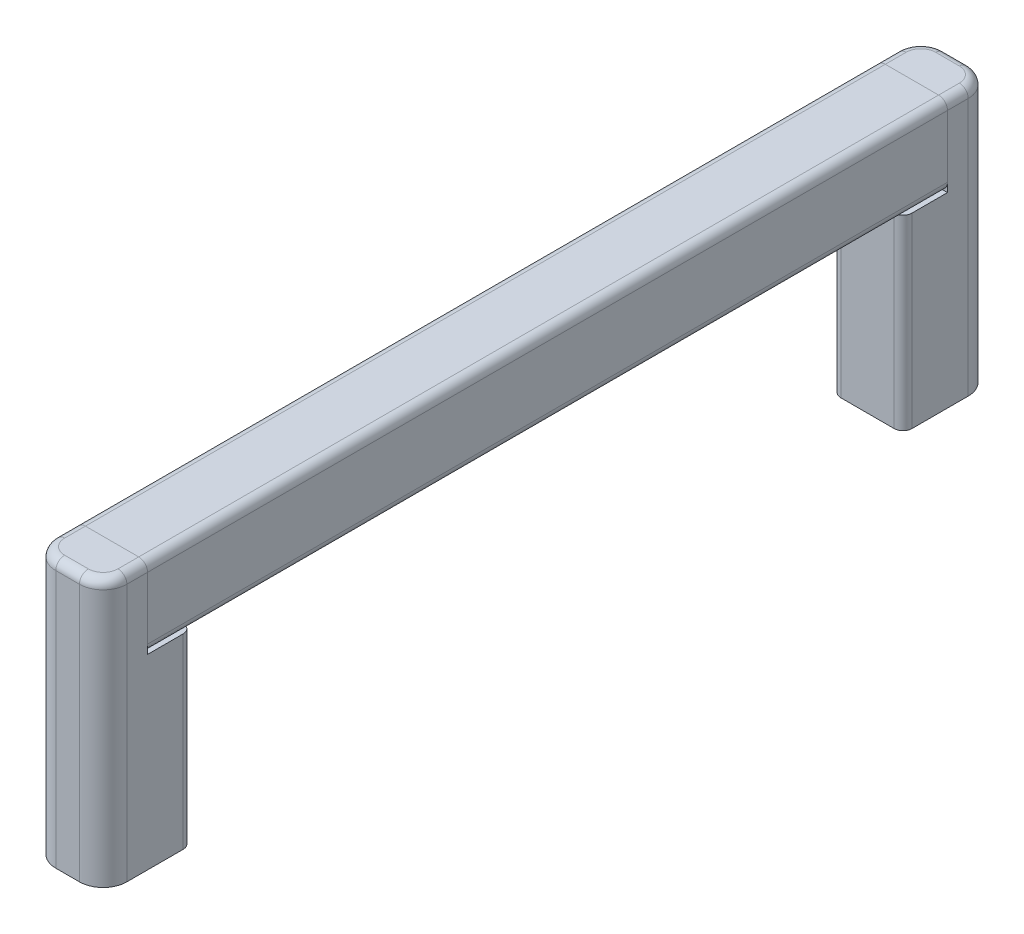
ISO-10303-21;
HEADER;
FILE_DESCRIPTION(('STEP AP214'),'2;1');
FILE_NAME('part.step','',(''),(''),'','','');
FILE_SCHEMA(('AUTOMOTIVE_DESIGN { 1 0 10303 214 1 1 1 1 }'));
ENDSEC;
DATA;
#1=APPLICATION_CONTEXT('core data for automotive mechanical design processes');
#2=APPLICATION_PROTOCOL_DEFINITION('international standard','automotive_design',2000,#1);
#3=PRODUCT_CONTEXT('',#1,'mechanical');
#4=PRODUCT('Part','Part','',(#3));
#5=PRODUCT_RELATED_PRODUCT_CATEGORY('part','',(#4));
#6=PRODUCT_DEFINITION_FORMATION('','',#4);
#7=PRODUCT_DEFINITION_CONTEXT('part definition',#1,'design');
#8=PRODUCT_DEFINITION('design','',#6,#7);
#9=PRODUCT_DEFINITION_SHAPE('','',#8);
#10=(LENGTH_UNIT() NAMED_UNIT(*) SI_UNIT(.MILLI.,.METRE.));
#11=(NAMED_UNIT(*) PLANE_ANGLE_UNIT() SI_UNIT($,.RADIAN.));
#12=(NAMED_UNIT(*) SI_UNIT($,.STERADIAN.) SOLID_ANGLE_UNIT());
#13=UNCERTAINTY_MEASURE_WITH_UNIT(LENGTH_MEASURE(1.E-05),#10,'distance_accuracy_value','');
#14=(GEOMETRIC_REPRESENTATION_CONTEXT(3) GLOBAL_UNCERTAINTY_ASSIGNED_CONTEXT((#13)) GLOBAL_UNIT_ASSIGNED_CONTEXT((#10,
#11,#12)) REPRESENTATION_CONTEXT('',''));
#15=CARTESIAN_POINT('',(0.,0.,0.));
#16=DIRECTION('',(0.,0.,1.));
#17=DIRECTION('',(1.,0.,0.));
#18=AXIS2_PLACEMENT_3D('',#15,#16,#17);
#19=CARTESIAN_POINT('',(-3.,3.50000000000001,45.));
#20=DIRECTION('',(0.,0.,1.));
#21=DIRECTION('',(1.,0.,0.));
#22=AXIS2_PLACEMENT_3D('',#19,#20,#21);
#23=PLANE('',#22);
#24=CARTESIAN_POINT('',(-3.,3.50000000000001,45.));
#25=DIRECTION('',(0.,0.,1.));
#26=DIRECTION('',(1.,0.,0.));
#27=AXIS2_PLACEMENT_3D('',#24,#25,#26);
#28=CIRCLE('',#27,1.);
#29=CARTESIAN_POINT('',(-3.,4.50000000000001,45.));
#30=VERTEX_POINT('',#29);
#31=CARTESIAN_POINT('',(-4.,3.50000000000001,45.));
#32=VERTEX_POINT('',#31);
#33=EDGE_CURVE('P0_E140',#30,#32,#28,.T.);
#34=ORIENTED_EDGE('',*,*,#33,.T.);
#35=DIRECTION('',(0.,-1.,0.));
#36=VECTOR('',#35,1.);
#37=CARTESIAN_POINT('',(-4.,3.50000000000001,45.));
#38=LINE('',#37,#36);
#39=CARTESIAN_POINT('',(-4.,-3.49999999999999,45.));
#40=VERTEX_POINT('',#39);
#41=EDGE_CURVE('P0_E129',#32,#40,#38,.T.);
#42=ORIENTED_EDGE('',*,*,#41,.T.);
#43=CARTESIAN_POINT('',(-3.,-3.49999999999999,45.));
#44=DIRECTION('',(0.,0.,1.));
#45=DIRECTION('',(1.,0.,0.));
#46=AXIS2_PLACEMENT_3D('',#43,#44,#45);
#47=CIRCLE('',#46,1.);
#48=CARTESIAN_POINT('',(-3.,-4.49999999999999,45.));
#49=VERTEX_POINT('',#48);
#50=EDGE_CURVE('P0_E139',#40,#49,#47,.T.);
#51=ORIENTED_EDGE('',*,*,#50,.T.);
#52=DIRECTION('',(1.,0.,0.));
#53=VECTOR('',#52,1.);
#54=CARTESIAN_POINT('',(-3.,-4.49999999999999,45.));
#55=LINE('',#54,#53);
#56=CARTESIAN_POINT('',(3.,-4.49999999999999,45.));
#57=VERTEX_POINT('',#56);
#58=EDGE_CURVE('P0_E224',#49,#57,#55,.T.);
#59=ORIENTED_EDGE('',*,*,#58,.T.);
#60=CARTESIAN_POINT('',(3.,-3.49999999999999,45.));
#61=DIRECTION('',(0.,0.,1.));
#62=DIRECTION('',(1.,0.,0.));
#63=AXIS2_PLACEMENT_3D('',#60,#61,#62);
#64=CIRCLE('',#63,1.);
#65=CARTESIAN_POINT('',(4.,-3.49999999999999,45.));
#66=VERTEX_POINT('',#65);
#67=EDGE_CURVE('P0_E226',#57,#66,#64,.T.);
#68=ORIENTED_EDGE('',*,*,#67,.T.);
#69=DIRECTION('',(0.,1.,0.));
#70=VECTOR('',#69,1.);
#71=CARTESIAN_POINT('',(4.,3.50000000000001,45.));
#72=LINE('',#71,#70);
#73=CARTESIAN_POINT('',(4.,3.50000000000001,45.));
#74=VERTEX_POINT('',#73);
#75=EDGE_CURVE('P0_E228',#66,#74,#72,.T.);
#76=ORIENTED_EDGE('',*,*,#75,.T.);
#77=CARTESIAN_POINT('',(3.,3.50000000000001,45.));
#78=DIRECTION('',(0.,0.,1.));
#79=DIRECTION('',(-1.,0.,0.));
#80=AXIS2_PLACEMENT_3D('',#77,#78,#79);
#81=CIRCLE('',#80,1.);
#82=CARTESIAN_POINT('',(3.,4.50000000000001,45.));
#83=VERTEX_POINT('',#82);
#84=EDGE_CURVE('P0_E230',#74,#83,#81,.T.);
#85=ORIENTED_EDGE('',*,*,#84,.T.);
#86=DIRECTION('',(-1.,0.,0.));
#87=VECTOR('',#86,1.);
#88=CARTESIAN_POINT('',(-3.,4.50000000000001,45.));
#89=LINE('',#88,#87);
#90=EDGE_CURVE('P0_E144',#83,#30,#89,.T.);
#91=ORIENTED_EDGE('',*,*,#90,.T.);
#92=EDGE_LOOP('',(#34,#42,#51,#59,#68,#76,#85,#91));
#93=FACE_BOUND('',#92,.T.);
#94=DIRECTION('',(-1.,0.,0.));
#95=VECTOR('',#94,1.);
#96=CARTESIAN_POINT('',(-1.33333333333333,1.5,45.));
#97=LINE('',#96,#95);
#98=CARTESIAN_POINT('',(0.833333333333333,1.5,45.));
#99=VERTEX_POINT('',#98);
#100=CARTESIAN_POINT('',(-0.833333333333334,1.5,45.));
#101=VERTEX_POINT('',#100);
#102=EDGE_CURVE('P0_E206',#99,#101,#97,.T.);
#103=ORIENTED_EDGE('',*,*,#102,.F.);
#104=CARTESIAN_POINT('',(0.833333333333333,0.999999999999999,45.));
#105=DIRECTION('',(0.,0.,1.));
#106=DIRECTION('',(1.,0.,0.));
#107=AXIS2_PLACEMENT_3D('',#104,#105,#106);
#108=CIRCLE('',#107,0.5);
#109=CARTESIAN_POINT('',(1.33333333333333,0.999999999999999,45.));
#110=VERTEX_POINT('',#109);
#111=EDGE_CURVE('P0_E187',#99,#110,#108,.F.);
#112=ORIENTED_EDGE('',*,*,#111,.T.);
#113=DIRECTION('',(0.,1.,0.));
#114=VECTOR('',#113,1.);
#115=CARTESIAN_POINT('',(1.33333333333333,-1.5,45.));
#116=LINE('',#115,#114);
#117=CARTESIAN_POINT('',(1.33333333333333,-0.999999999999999,45.));
#118=VERTEX_POINT('',#117);
#119=EDGE_CURVE('P0_E209',#118,#110,#116,.T.);
#120=ORIENTED_EDGE('',*,*,#119,.F.);
#121=CARTESIAN_POINT('',(0.833333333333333,-0.999999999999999,45.));
#122=DIRECTION('',(0.,0.,1.));
#123=DIRECTION('',(1.,0.,0.));
#124=AXIS2_PLACEMENT_3D('',#121,#122,#123);
#125=CIRCLE('',#124,0.5);
#126=CARTESIAN_POINT('',(0.833333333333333,-1.5,45.));
#127=VERTEX_POINT('',#126);
#128=EDGE_CURVE('P0_E183',#118,#127,#125,.F.);
#129=ORIENTED_EDGE('',*,*,#128,.T.);
#130=DIRECTION('',(1.,0.,0.));
#131=VECTOR('',#130,1.);
#132=CARTESIAN_POINT('',(-1.33333333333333,-1.5,45.));
#133=LINE('',#132,#131);
#134=CARTESIAN_POINT('',(-0.833333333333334,-1.5,45.));
#135=VERTEX_POINT('',#134);
#136=EDGE_CURVE('P0_E211',#135,#127,#133,.T.);
#137=ORIENTED_EDGE('',*,*,#136,.F.);
#138=CARTESIAN_POINT('',(-0.833333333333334,-0.999999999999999,45.));
#139=DIRECTION('',(0.,0.,1.));
#140=DIRECTION('',(1.,0.,0.));
#141=AXIS2_PLACEMENT_3D('',#138,#139,#140);
#142=CIRCLE('',#141,0.5);
#143=CARTESIAN_POINT('',(-1.33333333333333,-0.999999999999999,45.));
#144=VERTEX_POINT('',#143);
#145=EDGE_CURVE('P0_E179',#135,#144,#142,.F.);
#146=ORIENTED_EDGE('',*,*,#145,.T.);
#147=DIRECTION('',(0.,-1.,0.));
#148=VECTOR('',#147,1.);
#149=CARTESIAN_POINT('',(-1.33333333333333,-1.5,45.));
#150=LINE('',#149,#148);
#151=CARTESIAN_POINT('',(-1.33333333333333,1.,45.));
#152=VERTEX_POINT('',#151);
#153=EDGE_CURVE('P0_E208',#152,#144,#150,.T.);
#154=ORIENTED_EDGE('',*,*,#153,.F.);
#155=CARTESIAN_POINT('',(-0.833333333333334,1.,45.));
#156=DIRECTION('',(0.,0.,1.));
#157=DIRECTION('',(1.,0.,0.));
#158=AXIS2_PLACEMENT_3D('',#155,#156,#157);
#159=CIRCLE('',#158,0.5);
#160=EDGE_CURVE('P0_E11',#152,#101,#159,.F.);
#161=ORIENTED_EDGE('',*,*,#160,.T.);
#162=EDGE_LOOP('',(#103,#112,#120,#129,#137,#146,#154,#161));
#163=FACE_BOUND('',#162,.T.);
#164=ADVANCED_FACE('P0_F16',(#93,#163),#23,.T.);
#165=CARTESIAN_POINT('',(-3.,3.50000000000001,-45.));
#166=DIRECTION('',(0.,0.,1.));
#167=DIRECTION('',(1.,0.,0.));
#168=AXIS2_PLACEMENT_3D('',#165,#166,#167);
#169=PLANE('',#168);
#170=CARTESIAN_POINT('',(-3.,3.50000000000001,-45.));
#171=DIRECTION('',(0.,0.,1.));
#172=DIRECTION('',(1.,0.,0.));
#173=AXIS2_PLACEMENT_3D('',#170,#171,#172);
#174=CIRCLE('',#173,1.);
#175=CARTESIAN_POINT('',(-3.,4.50000000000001,-45.));
#176=VERTEX_POINT('',#175);
#177=CARTESIAN_POINT('',(-4.,3.50000000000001,-45.));
#178=VERTEX_POINT('',#177);
#179=EDGE_CURVE('P0_E152',#176,#178,#174,.T.);
#180=ORIENTED_EDGE('',*,*,#179,.F.);
#181=DIRECTION('',(-1.,0.,0.));
#182=VECTOR('',#181,1.);
#183=CARTESIAN_POINT('',(-3.,4.50000000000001,-45.));
#184=LINE('',#183,#182);
#185=CARTESIAN_POINT('',(3.,4.50000000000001,-45.));
#186=VERTEX_POINT('',#185);
#187=EDGE_CURVE('P0_E148',#186,#176,#184,.T.);
#188=ORIENTED_EDGE('',*,*,#187,.F.);
#189=CARTESIAN_POINT('',(3.,3.50000000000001,-45.));
#190=DIRECTION('',(0.,0.,1.));
#191=DIRECTION('',(-1.,0.,0.));
#192=AXIS2_PLACEMENT_3D('',#189,#190,#191);
#193=CIRCLE('',#192,1.);
#194=CARTESIAN_POINT('',(4.,3.50000000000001,-45.));
#195=VERTEX_POINT('',#194);
#196=EDGE_CURVE('P0_E245',#195,#186,#193,.T.);
#197=ORIENTED_EDGE('',*,*,#196,.F.);
#198=DIRECTION('',(0.,1.,0.));
#199=VECTOR('',#198,1.);
#200=CARTESIAN_POINT('',(4.,3.50000000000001,-45.));
#201=LINE('',#200,#199);
#202=CARTESIAN_POINT('',(4.,-3.49999999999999,-45.));
#203=VERTEX_POINT('',#202);
#204=EDGE_CURVE('P0_E243',#203,#195,#201,.T.);
#205=ORIENTED_EDGE('',*,*,#204,.F.);
#206=CARTESIAN_POINT('',(3.,-3.49999999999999,-45.));
#207=DIRECTION('',(0.,0.,1.));
#208=DIRECTION('',(1.,0.,0.));
#209=AXIS2_PLACEMENT_3D('',#206,#207,#208);
#210=CIRCLE('',#209,1.);
#211=CARTESIAN_POINT('',(3.,-4.49999999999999,-45.));
#212=VERTEX_POINT('',#211);
#213=EDGE_CURVE('P0_E241',#212,#203,#210,.T.);
#214=ORIENTED_EDGE('',*,*,#213,.F.);
#215=DIRECTION('',(1.,0.,0.));
#216=VECTOR('',#215,1.);
#217=CARTESIAN_POINT('',(-3.,-4.49999999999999,-45.));
#218=LINE('',#217,#216);
#219=CARTESIAN_POINT('',(-3.,-4.49999999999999,-45.));
#220=VERTEX_POINT('',#219);
#221=EDGE_CURVE('P0_E239',#220,#212,#218,.T.);
#222=ORIENTED_EDGE('',*,*,#221,.F.);
#223=CARTESIAN_POINT('',(-3.,-3.49999999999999,-45.));
#224=DIRECTION('',(0.,0.,1.));
#225=DIRECTION('',(1.,0.,0.));
#226=AXIS2_PLACEMENT_3D('',#223,#224,#225);
#227=CIRCLE('',#226,1.);
#228=CARTESIAN_POINT('',(-4.,-3.49999999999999,-45.));
#229=VERTEX_POINT('',#228);
#230=EDGE_CURVE('P0_E237',#229,#220,#227,.T.);
#231=ORIENTED_EDGE('',*,*,#230,.F.);
#232=DIRECTION('',(0.,-1.,0.));
#233=VECTOR('',#232,1.);
#234=CARTESIAN_POINT('',(-4.,3.50000000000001,-45.));
#235=LINE('',#234,#233);
#236=EDGE_CURVE('P0_E235',#178,#229,#235,.T.);
#237=ORIENTED_EDGE('',*,*,#236,.F.);
#238=EDGE_LOOP('',(#180,#188,#197,#205,#214,#222,#231,#237));
#239=FACE_BOUND('',#238,.T.);
#240=DIRECTION('',(1.,0.,0.));
#241=VECTOR('',#240,1.);
#242=CARTESIAN_POINT('',(-1.33333333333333,-1.5,-45.));
#243=LINE('',#242,#241);
#244=CARTESIAN_POINT('',(-0.833333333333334,-1.5,-45.));
#245=VERTEX_POINT('',#244);
#246=CARTESIAN_POINT('',(0.833333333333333,-1.5,-45.));
#247=VERTEX_POINT('',#246);
#248=EDGE_CURVE('P0_E203',#245,#247,#243,.T.);
#249=ORIENTED_EDGE('',*,*,#248,.T.);
#250=CARTESIAN_POINT('',(0.833333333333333,-0.999999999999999,-45.));
#251=DIRECTION('',(0.,0.,1.));
#252=DIRECTION('',(1.,0.,0.));
#253=AXIS2_PLACEMENT_3D('',#250,#251,#252);
#254=CIRCLE('',#253,0.5);
#255=CARTESIAN_POINT('',(1.33333333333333,-0.999999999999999,-45.));
#256=VERTEX_POINT('',#255);
#257=EDGE_CURVE('P0_E181',#247,#256,#254,.T.);
#258=ORIENTED_EDGE('',*,*,#257,.T.);
#259=DIRECTION('',(0.,1.,0.));
#260=VECTOR('',#259,1.);
#261=CARTESIAN_POINT('',(1.33333333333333,-1.5,-45.));
#262=LINE('',#261,#260);
#263=CARTESIAN_POINT('',(1.33333333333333,0.999999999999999,-45.));
#264=VERTEX_POINT('',#263);
#265=EDGE_CURVE('P0_E218',#256,#264,#262,.T.);
#266=ORIENTED_EDGE('',*,*,#265,.T.);
#267=CARTESIAN_POINT('',(0.833333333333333,0.999999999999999,-45.));
#268=DIRECTION('',(0.,0.,1.));
#269=DIRECTION('',(1.,0.,0.));
#270=AXIS2_PLACEMENT_3D('',#267,#268,#269);
#271=CIRCLE('',#270,0.5);
#272=CARTESIAN_POINT('',(0.833333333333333,1.5,-45.));
#273=VERTEX_POINT('',#272);
#274=EDGE_CURVE('P0_E185',#264,#273,#271,.T.);
#275=ORIENTED_EDGE('',*,*,#274,.T.);
#276=DIRECTION('',(-1.,0.,0.));
#277=VECTOR('',#276,1.);
#278=CARTESIAN_POINT('',(-1.33333333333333,1.5,-45.));
#279=LINE('',#278,#277);
#280=CARTESIAN_POINT('',(-0.833333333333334,1.5,-45.));
#281=VERTEX_POINT('',#280);
#282=EDGE_CURVE('P0_E195',#273,#281,#279,.T.);
#283=ORIENTED_EDGE('',*,*,#282,.T.);
#284=CARTESIAN_POINT('',(-0.833333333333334,1.,-45.));
#285=DIRECTION('',(0.,0.,1.));
#286=DIRECTION('',(1.,0.,0.));
#287=AXIS2_PLACEMENT_3D('',#284,#285,#286);
#288=CIRCLE('',#287,0.5);
#289=CARTESIAN_POINT('',(-1.33333333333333,1.,-45.));
#290=VERTEX_POINT('',#289);
#291=EDGE_CURVE('P0_E24',#281,#290,#288,.T.);
#292=ORIENTED_EDGE('',*,*,#291,.T.);
#293=DIRECTION('',(0.,-1.,0.));
#294=VECTOR('',#293,1.);
#295=CARTESIAN_POINT('',(-1.33333333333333,-1.5,-45.));
#296=LINE('',#295,#294);
#297=CARTESIAN_POINT('',(-1.33333333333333,-0.999999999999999,-45.));
#298=VERTEX_POINT('',#297);
#299=EDGE_CURVE('P0_E194',#290,#298,#296,.T.);
#300=ORIENTED_EDGE('',*,*,#299,.T.);
#301=CARTESIAN_POINT('',(-0.833333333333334,-0.999999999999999,-45.));
#302=DIRECTION('',(0.,0.,1.));
#303=DIRECTION('',(1.,0.,0.));
#304=AXIS2_PLACEMENT_3D('',#301,#302,#303);
#305=CIRCLE('',#304,0.5);
#306=EDGE_CURVE('P0_E177',#298,#245,#305,.T.);
#307=ORIENTED_EDGE('',*,*,#306,.T.);
#308=EDGE_LOOP('',(#249,#258,#266,#275,#283,#292,#300,#307));
#309=FACE_BOUND('',#308,.T.);
#310=ADVANCED_FACE('P0_F193',(#239,#309),#169,.F.);
#311=CARTESIAN_POINT('',(-3.,3.50000000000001,45.));
#312=DIRECTION('',(0.,0.,-1.));
#313=DIRECTION('',(-1.,0.,0.));
#314=AXIS2_PLACEMENT_3D('',#311,#312,#313);
#315=CYLINDRICAL_SURFACE('',#314,1.);
#316=ORIENTED_EDGE('',*,*,#179,.T.);
#317=DIRECTION('',(0.,0.,-1.));
#318=VECTOR('',#317,1.);
#319=CARTESIAN_POINT('',(-4.,3.50000000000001,45.));
#320=LINE('',#319,#318);
#321=EDGE_CURVE('P0_E133',#32,#178,#320,.T.);
#322=ORIENTED_EDGE('',*,*,#321,.F.);
#323=ORIENTED_EDGE('',*,*,#33,.F.);
#324=DIRECTION('',(0.,0.,-1.));
#325=VECTOR('',#324,1.);
#326=CARTESIAN_POINT('',(-3.,4.50000000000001,45.));
#327=LINE('',#326,#325);
#328=EDGE_CURVE('P0_E233',#30,#176,#327,.T.);
#329=ORIENTED_EDGE('',*,*,#328,.T.);
#330=EDGE_LOOP('',(#316,#322,#323,#329));
#331=FACE_BOUND('',#330,.T.);
#332=ADVANCED_FACE('P0_F150',(#331),#315,.T.);
#333=CARTESIAN_POINT('',(-4.,3.50000000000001,45.));
#334=DIRECTION('',(1.,0.,0.));
#335=DIRECTION('',(0.,0.,-1.));
#336=AXIS2_PLACEMENT_3D('',#333,#334,#335);
#337=PLANE('',#336);
#338=ORIENTED_EDGE('',*,*,#236,.T.);
#339=DIRECTION('',(0.,0.,-1.));
#340=VECTOR('',#339,1.);
#341=CARTESIAN_POINT('',(-4.,-3.49999999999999,45.));
#342=LINE('',#341,#340);
#343=EDGE_CURVE('P0_E136',#40,#229,#342,.T.);
#344=ORIENTED_EDGE('',*,*,#343,.F.);
#345=ORIENTED_EDGE('',*,*,#41,.F.);
#346=ORIENTED_EDGE('',*,*,#321,.T.);
#347=EDGE_LOOP('',(#338,#344,#345,#346));
#348=FACE_BOUND('',#347,.T.);
#349=ADVANCED_FACE('P0_F131',(#348),#337,.F.);
#350=CARTESIAN_POINT('',(-3.,-3.49999999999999,45.));
#351=DIRECTION('',(0.,0.,-1.));
#352=DIRECTION('',(-1.,0.,0.));
#353=AXIS2_PLACEMENT_3D('',#350,#351,#352);
#354=CYLINDRICAL_SURFACE('',#353,1.);
#355=ORIENTED_EDGE('',*,*,#230,.T.);
#356=DIRECTION('',(0.,0.,-1.));
#357=VECTOR('',#356,1.);
#358=CARTESIAN_POINT('',(-3.,-4.49999999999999,45.));
#359=LINE('',#358,#357);
#360=EDGE_CURVE('P0_E157',#49,#220,#359,.T.);
#361=ORIENTED_EDGE('',*,*,#360,.F.);
#362=ORIENTED_EDGE('',*,*,#50,.F.);
#363=ORIENTED_EDGE('',*,*,#343,.T.);
#364=EDGE_LOOP('',(#355,#361,#362,#363));
#365=FACE_BOUND('',#364,.T.);
#366=ADVANCED_FACE('P0_F283',(#365),#354,.T.);
#367=CARTESIAN_POINT('',(-3.,-4.49999999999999,45.));
#368=DIRECTION('',(0.,1.,0.));
#369=DIRECTION('',(0.,0.,1.));
#370=AXIS2_PLACEMENT_3D('',#367,#368,#369);
#371=PLANE('',#370);
#372=ORIENTED_EDGE('',*,*,#221,.T.);
#373=DIRECTION('',(0.,0.,-1.));
#374=VECTOR('',#373,1.);
#375=CARTESIAN_POINT('',(3.,-4.49999999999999,45.));
#376=LINE('',#375,#374);
#377=EDGE_CURVE('P0_E258',#57,#212,#376,.T.);
#378=ORIENTED_EDGE('',*,*,#377,.F.);
#379=ORIENTED_EDGE('',*,*,#58,.F.);
#380=ORIENTED_EDGE('',*,*,#360,.T.);
#381=EDGE_LOOP('',(#372,#378,#379,#380));
#382=FACE_BOUND('',#381,.T.);
#383=ADVANCED_FACE('P0_F265',(#382),#371,.F.);
#384=CARTESIAN_POINT('',(3.,-3.49999999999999,45.));
#385=DIRECTION('',(0.,0.,-1.));
#386=DIRECTION('',(-1.,0.,0.));
#387=AXIS2_PLACEMENT_3D('',#384,#385,#386);
#388=CYLINDRICAL_SURFACE('',#387,1.);
#389=ORIENTED_EDGE('',*,*,#213,.T.);
#390=DIRECTION('',(0.,0.,-1.));
#391=VECTOR('',#390,1.);
#392=CARTESIAN_POINT('',(4.,-3.49999999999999,45.));
#393=LINE('',#392,#391);
#394=EDGE_CURVE('P0_E255',#66,#203,#393,.T.);
#395=ORIENTED_EDGE('',*,*,#394,.F.);
#396=ORIENTED_EDGE('',*,*,#67,.F.);
#397=ORIENTED_EDGE('',*,*,#377,.T.);
#398=EDGE_LOOP('',(#389,#395,#396,#397));
#399=FACE_BOUND('',#398,.T.);
#400=ADVANCED_FACE('P0_F275',(#399),#388,.T.);
#401=CARTESIAN_POINT('',(4.,3.50000000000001,45.));
#402=DIRECTION('',(-1.,0.,0.));
#403=DIRECTION('',(0.,0.,1.));
#404=AXIS2_PLACEMENT_3D('',#401,#402,#403);
#405=PLANE('',#404);
#406=ORIENTED_EDGE('',*,*,#204,.T.);
#407=DIRECTION('',(0.,0.,-1.));
#408=VECTOR('',#407,1.);
#409=CARTESIAN_POINT('',(4.,3.50000000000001,45.));
#410=LINE('',#409,#408);
#411=EDGE_CURVE('P0_E252',#74,#195,#410,.T.);
#412=ORIENTED_EDGE('',*,*,#411,.F.);
#413=ORIENTED_EDGE('',*,*,#75,.F.);
#414=ORIENTED_EDGE('',*,*,#394,.T.);
#415=EDGE_LOOP('',(#406,#412,#413,#414));
#416=FACE_BOUND('',#415,.T.);
#417=ADVANCED_FACE('P0_F279',(#416),#405,.F.);
#418=CARTESIAN_POINT('',(3.,3.50000000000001,45.));
#419=DIRECTION('',(0.,0.,-1.));
#420=DIRECTION('',(-1.,0.,0.));
#421=AXIS2_PLACEMENT_3D('',#418,#419,#420);
#422=CYLINDRICAL_SURFACE('',#421,1.);
#423=ORIENTED_EDGE('',*,*,#196,.T.);
#424=DIRECTION('',(0.,0.,-1.));
#425=VECTOR('',#424,1.);
#426=CARTESIAN_POINT('',(3.,4.50000000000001,45.));
#427=LINE('',#426,#425);
#428=EDGE_CURVE('P0_E249',#83,#186,#427,.T.);
#429=ORIENTED_EDGE('',*,*,#428,.F.);
#430=ORIENTED_EDGE('',*,*,#84,.F.);
#431=ORIENTED_EDGE('',*,*,#411,.T.);
#432=EDGE_LOOP('',(#423,#429,#430,#431));
#433=FACE_BOUND('',#432,.T.);
#434=ADVANCED_FACE('P0_F306',(#433),#422,.T.);
#435=CARTESIAN_POINT('',(-3.,4.50000000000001,45.));
#436=DIRECTION('',(0.,-1.,0.));
#437=DIRECTION('',(0.,0.,-1.));
#438=AXIS2_PLACEMENT_3D('',#435,#436,#437);
#439=PLANE('',#438);
#440=ORIENTED_EDGE('',*,*,#187,.T.);
#441=ORIENTED_EDGE('',*,*,#328,.F.);
#442=ORIENTED_EDGE('',*,*,#90,.F.);
#443=ORIENTED_EDGE('',*,*,#428,.T.);
#444=EDGE_LOOP('',(#440,#441,#442,#443));
#445=FACE_BOUND('',#444,.T.);
#446=ADVANCED_FACE('P0_F303',(#445),#439,.F.);
#447=CARTESIAN_POINT('',(1.33333333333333,-1.5,45.));
#448=DIRECTION('',(-1.,0.,0.));
#449=DIRECTION('',(0.,0.,1.));
#450=AXIS2_PLACEMENT_3D('',#447,#448,#449);
#451=PLANE('',#450);
#452=ORIENTED_EDGE('',*,*,#265,.F.);
#453=DIRECTION('',(0.,0.,-1.));
#454=VECTOR('',#453,1.);
#455=CARTESIAN_POINT('',(1.33333333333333,-0.999999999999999,45.));
#456=LINE('',#455,#454);
#457=EDGE_CURVE('P0_E171',#256,#118,#456,.F.);
#458=ORIENTED_EDGE('',*,*,#457,.T.);
#459=ORIENTED_EDGE('',*,*,#119,.T.);
#460=DIRECTION('',(0.,0.,-1.));
#461=VECTOR('',#460,1.);
#462=CARTESIAN_POINT('',(1.33333333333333,0.999999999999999,-45.));
#463=LINE('',#462,#461);
#464=EDGE_CURVE('P0_E168',#110,#264,#463,.T.);
#465=ORIENTED_EDGE('',*,*,#464,.T.);
#466=EDGE_LOOP('',(#452,#458,#459,#465));
#467=FACE_BOUND('',#466,.T.);
#468=ADVANCED_FACE('P0_F300',(#467),#451,.T.);
#469=CARTESIAN_POINT('',(-1.33333333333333,1.5,45.));
#470=DIRECTION('',(0.,-1.,0.));
#471=DIRECTION('',(1.,0.,0.));
#472=AXIS2_PLACEMENT_3D('',#469,#470,#471);
#473=PLANE('',#472);
#474=ORIENTED_EDGE('',*,*,#282,.F.);
#475=DIRECTION('',(0.,0.,-1.));
#476=VECTOR('',#475,1.);
#477=CARTESIAN_POINT('',(0.833333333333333,1.5,45.));
#478=LINE('',#477,#476);
#479=EDGE_CURVE('P0_E36',#273,#99,#478,.F.);
#480=ORIENTED_EDGE('',*,*,#479,.T.);
#481=ORIENTED_EDGE('',*,*,#102,.T.);
#482=DIRECTION('',(0.,0.,-1.));
#483=VECTOR('',#482,1.);
#484=CARTESIAN_POINT('',(-0.833333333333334,1.5,-45.));
#485=LINE('',#484,#483);
#486=EDGE_CURVE('P0_E173',#101,#281,#485,.T.);
#487=ORIENTED_EDGE('',*,*,#486,.T.);
#488=EDGE_LOOP('',(#474,#480,#481,#487));
#489=FACE_BOUND('',#488,.T.);
#490=ADVANCED_FACE('P0_F205',(#489),#473,.T.);
#491=CARTESIAN_POINT('',(-1.33333333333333,-1.5,45.));
#492=DIRECTION('',(1.,0.,0.));
#493=DIRECTION('',(0.,0.,-1.));
#494=AXIS2_PLACEMENT_3D('',#491,#492,#493);
#495=PLANE('',#494);
#496=ORIENTED_EDGE('',*,*,#153,.T.);
#497=DIRECTION('',(0.,0.,-1.));
#498=VECTOR('',#497,1.);
#499=CARTESIAN_POINT('',(-1.33333333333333,-0.999999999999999,-45.));
#500=LINE('',#499,#498);
#501=EDGE_CURVE('P0_E155',#144,#298,#500,.T.);
#502=ORIENTED_EDGE('',*,*,#501,.T.);
#503=ORIENTED_EDGE('',*,*,#299,.F.);
#504=DIRECTION('',(0.,0.,-1.));
#505=VECTOR('',#504,1.);
#506=CARTESIAN_POINT('',(-1.33333333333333,1.,45.));
#507=LINE('',#506,#505);
#508=EDGE_CURVE('P0_E153',#290,#152,#507,.F.);
#509=ORIENTED_EDGE('',*,*,#508,.T.);
#510=EDGE_LOOP('',(#496,#502,#503,#509));
#511=FACE_BOUND('',#510,.T.);
#512=ADVANCED_FACE('P0_F201',(#511),#495,.T.);
#513=CARTESIAN_POINT('',(-1.33333333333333,-1.5,45.));
#514=DIRECTION('',(0.,1.,0.));
#515=DIRECTION('',(0.,0.,1.));
#516=AXIS2_PLACEMENT_3D('',#513,#514,#515);
#517=PLANE('',#516);
#518=ORIENTED_EDGE('',*,*,#248,.F.);
#519=DIRECTION('',(0.,0.,-1.));
#520=VECTOR('',#519,1.);
#521=CARTESIAN_POINT('',(-0.833333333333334,-1.5,45.));
#522=LINE('',#521,#520);
#523=EDGE_CURVE('P0_E166',#245,#135,#522,.F.);
#524=ORIENTED_EDGE('',*,*,#523,.T.);
#525=ORIENTED_EDGE('',*,*,#136,.T.);
#526=DIRECTION('',(0.,0.,-1.));
#527=VECTOR('',#526,1.);
#528=CARTESIAN_POINT('',(0.833333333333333,-1.5,-45.));
#529=LINE('',#528,#527);
#530=EDGE_CURVE('P0_E163',#127,#247,#529,.T.);
#531=ORIENTED_EDGE('',*,*,#530,.T.);
#532=EDGE_LOOP('',(#518,#524,#525,#531));
#533=FACE_BOUND('',#532,.T.);
#534=ADVANCED_FACE('P0_F355',(#533),#517,.T.);
#535=CARTESIAN_POINT('',(-0.833333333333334,-0.999999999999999,45.));
#536=DIRECTION('',(0.,0.,1.));
#537=DIRECTION('',(1.,0.,0.));
#538=AXIS2_PLACEMENT_3D('',#535,#536,#537);
#539=CYLINDRICAL_SURFACE('',#538,0.5);
#540=ORIENTED_EDGE('',*,*,#145,.F.);
#541=ORIENTED_EDGE('',*,*,#523,.F.);
#542=ORIENTED_EDGE('',*,*,#306,.F.);
#543=ORIENTED_EDGE('',*,*,#501,.F.);
#544=EDGE_LOOP('',(#540,#541,#542,#543));
#545=FACE_BOUND('',#544,.T.);
#546=ADVANCED_FACE('P0_F363',(#545),#539,.F.);
#547=CARTESIAN_POINT('',(0.833333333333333,-0.999999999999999,45.));
#548=DIRECTION('',(0.,0.,1.));
#549=DIRECTION('',(1.,0.,0.));
#550=AXIS2_PLACEMENT_3D('',#547,#548,#549);
#551=CYLINDRICAL_SURFACE('',#550,0.5);
#552=ORIENTED_EDGE('',*,*,#128,.F.);
#553=ORIENTED_EDGE('',*,*,#457,.F.);
#554=ORIENTED_EDGE('',*,*,#257,.F.);
#555=ORIENTED_EDGE('',*,*,#530,.F.);
#556=EDGE_LOOP('',(#552,#553,#554,#555));
#557=FACE_BOUND('',#556,.T.);
#558=ADVANCED_FACE('P0_F372',(#557),#551,.F.);
#559=CARTESIAN_POINT('',(0.833333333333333,0.999999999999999,45.));
#560=DIRECTION('',(0.,0.,1.));
#561=DIRECTION('',(1.,0.,0.));
#562=AXIS2_PLACEMENT_3D('',#559,#560,#561);
#563=CYLINDRICAL_SURFACE('',#562,0.5);
#564=ORIENTED_EDGE('',*,*,#111,.F.);
#565=ORIENTED_EDGE('',*,*,#479,.F.);
#566=ORIENTED_EDGE('',*,*,#274,.F.);
#567=ORIENTED_EDGE('',*,*,#464,.F.);
#568=EDGE_LOOP('',(#564,#565,#566,#567));
#569=FACE_BOUND('',#568,.T.);
#570=ADVANCED_FACE('P0_F381',(#569),#563,.F.);
#571=CARTESIAN_POINT('',(-0.833333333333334,1.,45.));
#572=DIRECTION('',(0.,0.,1.));
#573=DIRECTION('',(1.,0.,0.));
#574=AXIS2_PLACEMENT_3D('',#571,#572,#573);
#575=CYLINDRICAL_SURFACE('',#574,0.5);
#576=ORIENTED_EDGE('',*,*,#160,.F.);
#577=ORIENTED_EDGE('',*,*,#508,.F.);
#578=ORIENTED_EDGE('',*,*,#291,.F.);
#579=ORIENTED_EDGE('',*,*,#486,.F.);
#580=EDGE_LOOP('',(#576,#577,#578,#579));
#581=FACE_BOUND('',#580,.T.);
#582=ADVANCED_FACE('P0_F18',(#581),#575,.F.);
#583=CLOSED_SHELL('',(#164,#310,#332,#349,#366,#383,#400,#417,#434,#446,#468,#490,#512,#534,
#546,#558,#570,#582));
#584=MANIFOLD_SOLID_BREP('P0_B1',#583);
#585=CARTESIAN_POINT('',(0.,-25.5,-45.));
#586=DIRECTION('',(0.,1.,0.));
#587=DIRECTION('',(-1.,0.,0.));
#588=AXIS2_PLACEMENT_3D('',#585,#586,#587);
#589=CYLINDRICAL_SURFACE('',#588,3.24999999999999);
#590=CARTESIAN_POINT('',(0.,-11.2769088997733,-45.));
#591=DIRECTION('',(0.,1.,0.));
#592=DIRECTION('',(-1.,0.,0.));
#593=AXIS2_PLACEMENT_3D('',#590,#591,#592);
#594=CIRCLE('',#593,3.24999999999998);
#595=CARTESIAN_POINT('',(-3.24999999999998,-11.2769088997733,-45.));
#596=VERTEX_POINT('',#595);
#597=EDGE_CURVE('P1_E11',#596,#596,#594,.T.);
#598=ORIENTED_EDGE('',*,*,#597,.F.);
#599=EDGE_LOOP('',(#598));
#600=FACE_BOUND('',#599,.T.);
#601=CARTESIAN_POINT('',(0.,-25.5,-45.));
#602=DIRECTION('',(0.,1.,0.));
#603=DIRECTION('',(-1.,0.,0.));
#604=AXIS2_PLACEMENT_3D('',#601,#602,#603);
#605=CIRCLE('',#604,3.25);
#606=CARTESIAN_POINT('',(-3.25,-25.5,-45.));
#607=VERTEX_POINT('',#606);
#608=EDGE_CURVE('P1_E51',#607,#607,#605,.T.);
#609=ORIENTED_EDGE('',*,*,#608,.T.);
#610=EDGE_LOOP('',(#609));
#611=FACE_BOUND('',#610,.T.);
#612=ADVANCED_FACE('P1_F16',(#600,#611),#589,.T.);
#613=CARTESIAN_POINT('',(0.,-11.2769088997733,-45.));
#614=DIRECTION('',(0.,1.,0.));
#615=DIRECTION('',(-1.,0.,0.));
#616=AXIS2_PLACEMENT_3D('',#613,#614,#615);
#617=TOROIDAL_SURFACE('',#616,2.25,0.999999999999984);
#618=CARTESIAN_POINT('',(0.,-10.2807142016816,-45.));
#619=DIRECTION('',(0.,1.,0.));
#620=DIRECTION('',(-1.,0.,0.));
#621=AXIS2_PLACEMENT_3D('',#618,#619,#620);
#622=CIRCLE('',#621,2.33715574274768);
#623=CARTESIAN_POINT('',(-2.33715574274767,-10.2807142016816,-45.));
#624=VERTEX_POINT('',#623);
#625=EDGE_CURVE('P1_E23',#624,#624,#622,.T.);
#626=ORIENTED_EDGE('',*,*,#625,.F.);
#627=EDGE_LOOP('',(#626));
#628=FACE_BOUND('',#627,.T.);
#629=ORIENTED_EDGE('',*,*,#597,.T.);
#630=EDGE_LOOP('',(#629));
#631=FACE_BOUND('',#630,.T.);
#632=ADVANCED_FACE('P1_F33',(#628,#631),#617,.T.);
#633=CARTESIAN_POINT('',(0.,-10.2807142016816,-45.));
#634=DIRECTION('',(0.,-1.,0.));
#635=DIRECTION('',(1.,0.,0.));
#636=AXIS2_PLACEMENT_3D('',#633,#634,#635);
#637=CONICAL_SURFACE('',#636,2.33715574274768,1.48352986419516);
#638=CARTESIAN_POINT('',(0.,-10.0762395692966,-45.));
#639=VERTEX_POINT('',#638);
#640=VERTEX_LOOP('',#639);
#641=FACE_BOUND('',#640,.T.);
#642=ORIENTED_EDGE('',*,*,#625,.T.);
#643=EDGE_LOOP('',(#642));
#644=FACE_BOUND('',#643,.T.);
#645=ADVANCED_FACE('P1_F29',(#641,#644),#637,.T.);
#646=CARTESIAN_POINT('',(0.,-13.5762395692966,-45.));
#647=DIRECTION('',(0.,-1.,0.));
#648=DIRECTION('',(1.,0.,0.));
#649=AXIS2_PLACEMENT_3D('',#646,#647,#648);
#650=CONICAL_SURFACE('',#649,0.,1.04719755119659);
#651=CARTESIAN_POINT('',(0.,-14.5,-45.));
#652=DIRECTION('',(0.,1.,0.));
#653=DIRECTION('',(-1.,0.,0.));
#654=AXIS2_PLACEMENT_3D('',#651,#652,#653);
#655=CIRCLE('',#654,1.6);
#656=CARTESIAN_POINT('',(-1.6,-14.5,-45.));
#657=VERTEX_POINT('',#656);
#658=EDGE_CURVE('P1_E38',#657,#657,#655,.T.);
#659=ORIENTED_EDGE('',*,*,#658,.F.);
#660=EDGE_LOOP('',(#659));
#661=FACE_BOUND('',#660,.T.);
#662=CARTESIAN_POINT('',(0.,-13.5762395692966,-45.));
#663=VERTEX_POINT('',#662);
#664=VERTEX_LOOP('',#663);
#665=FACE_BOUND('',#664,.T.);
#666=ADVANCED_FACE('P1_F32',(#661,#665),#650,.F.);
#667=CARTESIAN_POINT('',(0.,-25.5,-45.));
#668=DIRECTION('',(0.,1.,0.));
#669=DIRECTION('',(-1.,0.,0.));
#670=AXIS2_PLACEMENT_3D('',#667,#668,#669);
#671=CYLINDRICAL_SURFACE('',#670,1.6);
#672=CARTESIAN_POINT('',(0.,-17.5,-45.));
#673=DIRECTION('',(0.,1.,0.));
#674=DIRECTION('',(-1.,0.,0.));
#675=AXIS2_PLACEMENT_3D('',#672,#673,#674);
#676=CIRCLE('',#675,1.6);
#677=CARTESIAN_POINT('',(-1.6,-17.5,-45.));
#678=VERTEX_POINT('',#677);
#679=EDGE_CURVE('P1_E40',#678,#678,#676,.T.);
#680=ORIENTED_EDGE('',*,*,#679,.F.);
#681=EDGE_LOOP('',(#680));
#682=FACE_BOUND('',#681,.T.);
#683=ORIENTED_EDGE('',*,*,#658,.T.);
#684=EDGE_LOOP('',(#683));
#685=FACE_BOUND('',#684,.T.);
#686=ADVANCED_FACE('P1_F71',(#682,#685),#671,.F.);
#687=CARTESIAN_POINT('',(0.,-17.5,-43.));
#688=DIRECTION('',(0.,1.,0.));
#689=DIRECTION('',(-1.,0.,0.));
#690=AXIS2_PLACEMENT_3D('',#687,#688,#689);
#691=PLANE('',#690);
#692=CARTESIAN_POINT('',(0.,-17.5,-45.));
#693=DIRECTION('',(0.,1.,0.));
#694=DIRECTION('',(-1.,0.,0.));
#695=AXIS2_PLACEMENT_3D('',#692,#693,#694);
#696=CIRCLE('',#695,2.);
#697=CARTESIAN_POINT('',(-2.,-17.5,-45.));
#698=VERTEX_POINT('',#697);
#699=EDGE_CURVE('P1_E45',#698,#698,#696,.T.);
#700=ORIENTED_EDGE('',*,*,#699,.F.);
#701=EDGE_LOOP('',(#700));
#702=FACE_BOUND('',#701,.T.);
#703=ORIENTED_EDGE('',*,*,#679,.T.);
#704=EDGE_LOOP('',(#703));
#705=FACE_BOUND('',#704,.T.);
#706=ADVANCED_FACE('P1_F65',(#702,#705),#691,.F.);
#707=CARTESIAN_POINT('',(0.,-25.5,-45.));
#708=DIRECTION('',(0.,1.,0.));
#709=DIRECTION('',(-1.,0.,0.));
#710=AXIS2_PLACEMENT_3D('',#707,#708,#709);
#711=CYLINDRICAL_SURFACE('',#710,2.);
#712=CARTESIAN_POINT('',(0.,-25.5,-45.));
#713=DIRECTION('',(0.,1.,0.));
#714=DIRECTION('',(-1.,0.,0.));
#715=AXIS2_PLACEMENT_3D('',#712,#713,#714);
#716=CIRCLE('',#715,2.);
#717=CARTESIAN_POINT('',(-2.,-25.5,-45.));
#718=VERTEX_POINT('',#717);
#719=EDGE_CURVE('P1_E48',#718,#718,#716,.T.);
#720=ORIENTED_EDGE('',*,*,#719,.F.);
#721=EDGE_LOOP('',(#720));
#722=FACE_BOUND('',#721,.T.);
#723=ORIENTED_EDGE('',*,*,#699,.T.);
#724=EDGE_LOOP('',(#723));
#725=FACE_BOUND('',#724,.T.);
#726=ADVANCED_FACE('P1_F59',(#722,#725),#711,.F.);
#727=CARTESIAN_POINT('',(0.,-25.5,-43.));
#728=DIRECTION('',(0.,1.,0.));
#729=DIRECTION('',(-1.,0.,0.));
#730=AXIS2_PLACEMENT_3D('',#727,#728,#729);
#731=PLANE('',#730);
#732=ORIENTED_EDGE('',*,*,#608,.F.);
#733=EDGE_LOOP('',(#732));
#734=FACE_BOUND('',#733,.T.);
#735=ORIENTED_EDGE('',*,*,#719,.T.);
#736=EDGE_LOOP('',(#735));
#737=FACE_BOUND('',#736,.T.);
#738=ADVANCED_FACE('P1_F56',(#734,#737),#731,.F.);
#739=CLOSED_SHELL('',(#612,#632,#645,#666,#686,#706,#726,#738));
#740=MANIFOLD_SOLID_BREP('P1_B1',#739);
#741=CARTESIAN_POINT('',(-1.33333333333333,-25.5,-47.3333333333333));
#742=DIRECTION('',(0.,1.,0.));
#743=DIRECTION('',(-1.,0.,0.));
#744=AXIS2_PLACEMENT_3D('',#741,#742,#743);
#745=PLANE('',#744);
#746=DIRECTION('',(0.,0.,-1.));
#747=VECTOR('',#746,1.);
#748=CARTESIAN_POINT('',(4.,-25.5,-47.3333333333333));
#749=LINE('',#748,#747);
#750=CARTESIAN_POINT('',(4.,-25.5,-41.));
#751=VERTEX_POINT('',#750);
#752=CARTESIAN_POINT('',(4.,-25.5,-47.3333333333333));
#753=VERTEX_POINT('',#752);
#754=EDGE_CURVE('P2_E225',#751,#753,#749,.T.);
#755=ORIENTED_EDGE('',*,*,#754,.F.);
#756=CARTESIAN_POINT('',(3.,-25.5,-41.));
#757=DIRECTION('',(0.,1.,0.));
#758=DIRECTION('',(-1.,0.,0.));
#759=AXIS2_PLACEMENT_3D('',#756,#757,#758);
#760=CIRCLE('',#759,1.);
#761=CARTESIAN_POINT('',(3.,-25.5,-40.));
#762=VERTEX_POINT('',#761);
#763=EDGE_CURVE('P2_E276',#751,#762,#760,.F.);
#764=ORIENTED_EDGE('',*,*,#763,.T.);
#765=DIRECTION('',(1.,0.,0.));
#766=VECTOR('',#765,1.);
#767=CARTESIAN_POINT('',(4.,-25.5,-40.));
#768=LINE('',#767,#766);
#769=CARTESIAN_POINT('',(-3.,-25.5,-40.));
#770=VERTEX_POINT('',#769);
#771=EDGE_CURVE('P2_E220',#770,#762,#768,.T.);
#772=ORIENTED_EDGE('',*,*,#771,.F.);
#773=CARTESIAN_POINT('',(-3.,-25.5,-41.));
#774=DIRECTION('',(0.,1.,0.));
#775=DIRECTION('',(-1.,0.,0.));
#776=AXIS2_PLACEMENT_3D('',#773,#774,#775);
#777=CIRCLE('',#776,1.);
#778=CARTESIAN_POINT('',(-4.,-25.5,-41.));
#779=VERTEX_POINT('',#778);
#780=EDGE_CURVE('P2_E274',#770,#779,#777,.F.);
#781=ORIENTED_EDGE('',*,*,#780,.T.);
#782=DIRECTION('',(0.,0.,1.));
#783=VECTOR('',#782,1.);
#784=CARTESIAN_POINT('',(-4.,-25.5,-47.3333333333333));
#785=LINE('',#784,#783);
#786=CARTESIAN_POINT('',(-4.,-25.5,-47.3333333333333));
#787=VERTEX_POINT('',#786);
#788=EDGE_CURVE('P2_E237',#787,#779,#785,.T.);
#789=ORIENTED_EDGE('',*,*,#788,.F.);
#790=CARTESIAN_POINT('',(-1.33333333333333,-25.5,-47.3333333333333));
#791=DIRECTION('',(0.,1.,0.));
#792=DIRECTION('',(-1.,0.,0.));
#793=AXIS2_PLACEMENT_3D('',#790,#791,#792);
#794=CIRCLE('',#793,2.66666666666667);
#795=CARTESIAN_POINT('',(-1.33333333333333,-25.5,-50.));
#796=VERTEX_POINT('',#795);
#797=EDGE_CURVE('P2_E234',#796,#787,#794,.T.);
#798=ORIENTED_EDGE('',*,*,#797,.F.);
#799=DIRECTION('',(-1.,0.,0.));
#800=VECTOR('',#799,1.);
#801=CARTESIAN_POINT('',(1.33333333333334,-25.5,-50.));
#802=LINE('',#801,#800);
#803=CARTESIAN_POINT('',(1.33333333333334,-25.5,-50.));
#804=VERTEX_POINT('',#803);
#805=EDGE_CURVE('P2_E231',#804,#796,#802,.T.);
#806=ORIENTED_EDGE('',*,*,#805,.F.);
#807=CARTESIAN_POINT('',(1.33333333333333,-25.5,-47.3333333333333));
#808=DIRECTION('',(0.,1.,0.));
#809=DIRECTION('',(-1.,0.,0.));
#810=AXIS2_PLACEMENT_3D('',#807,#808,#809);
#811=CIRCLE('',#810,2.66666666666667);
#812=EDGE_CURVE('P2_E228',#753,#804,#811,.T.);
#813=ORIENTED_EDGE('',*,*,#812,.F.);
#814=EDGE_LOOP('',(#755,#764,#772,#781,#789,#798,#806,#813));
#815=FACE_BOUND('',#814,.T.);
#816=CARTESIAN_POINT('',(0.,-25.5,-45.));
#817=DIRECTION('',(0.,1.,0.));
#818=DIRECTION('',(0.,0.,-1.));
#819=AXIS2_PLACEMENT_3D('',#816,#817,#818);
#820=CIRCLE('',#819,3.25);
#821=CARTESIAN_POINT('',(0.,-25.5,-48.25));
#822=VERTEX_POINT('',#821);
#823=EDGE_CURVE('P2_E172',#822,#822,#820,.T.);
#824=ORIENTED_EDGE('',*,*,#823,.T.);
#825=EDGE_LOOP('',(#824));
#826=FACE_BOUND('',#825,.T.);
#827=ADVANCED_FACE('P2_F16',(#815,#826),#745,.F.);
#828=CARTESIAN_POINT('',(4.,-4.5,-45.));
#829=DIRECTION('',(0.,0.,-1.));
#830=DIRECTION('',(-1.,0.,0.));
#831=AXIS2_PLACEMENT_3D('',#828,#829,#830);
#832=PLANE('',#831);
#833=DIRECTION('',(0.,1.,0.));
#834=VECTOR('',#833,1.);
#835=CARTESIAN_POINT('',(4.,-4.5,-45.));
#836=LINE('',#835,#834);
#837=CARTESIAN_POINT('',(4.,-4.5,-45.));
#838=VERTEX_POINT('',#837);
#839=CARTESIAN_POINT('',(4.,3.5,-45.));
#840=VERTEX_POINT('',#839);
#841=EDGE_CURVE('P2_E217',#838,#840,#836,.T.);
#842=ORIENTED_EDGE('',*,*,#841,.T.);
#843=CARTESIAN_POINT('',(3.,3.5,-45.));
#844=DIRECTION('',(0.,0.,-1.));
#845=DIRECTION('',(-1.,0.,0.));
#846=AXIS2_PLACEMENT_3D('',#843,#844,#845);
#847=CIRCLE('',#846,1.);
#848=CARTESIAN_POINT('',(3.,4.5,-45.));
#849=VERTEX_POINT('',#848);
#850=EDGE_CURVE('P2_E266',#840,#849,#847,.F.);
#851=ORIENTED_EDGE('',*,*,#850,.T.);
#852=DIRECTION('',(-1.,0.,0.));
#853=VECTOR('',#852,1.);
#854=CARTESIAN_POINT('',(4.,4.5,-45.));
#855=LINE('',#854,#853);
#856=CARTESIAN_POINT('',(-3.,4.5,-45.));
#857=VERTEX_POINT('',#856);
#858=EDGE_CURVE('P2_E191',#849,#857,#855,.T.);
#859=ORIENTED_EDGE('',*,*,#858,.T.);
#860=CARTESIAN_POINT('',(-3.,3.5,-45.));
#861=DIRECTION('',(0.,0.,-1.));
#862=DIRECTION('',(-1.,0.,0.));
#863=AXIS2_PLACEMENT_3D('',#860,#861,#862);
#864=CIRCLE('',#863,1.);
#865=CARTESIAN_POINT('',(-4.,3.5,-45.));
#866=VERTEX_POINT('',#865);
#867=EDGE_CURVE('P2_E264',#857,#866,#864,.F.);
#868=ORIENTED_EDGE('',*,*,#867,.T.);
#869=DIRECTION('',(0.,1.,0.));
#870=VECTOR('',#869,1.);
#871=CARTESIAN_POINT('',(-4.,-4.5,-45.));
#872=LINE('',#871,#870);
#873=CARTESIAN_POINT('',(-4.,-4.5,-45.));
#874=VERTEX_POINT('',#873);
#875=EDGE_CURVE('P2_E214',#874,#866,#872,.T.);
#876=ORIENTED_EDGE('',*,*,#875,.F.);
#877=DIRECTION('',(-1.,0.,0.));
#878=VECTOR('',#877,1.);
#879=CARTESIAN_POINT('',(4.,-4.5,-45.));
#880=LINE('',#879,#878);
#881=EDGE_CURVE('P2_E203',#838,#874,#880,.T.);
#882=ORIENTED_EDGE('',*,*,#881,.F.);
#883=EDGE_LOOP('',(#842,#851,#859,#868,#876,#882));
#884=FACE_BOUND('',#883,.T.);
#885=DIRECTION('',(0.,-1.,0.));
#886=VECTOR('',#885,1.);
#887=CARTESIAN_POINT('',(-1.33333333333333,1.5,-45.));
#888=LINE('',#887,#886);
#889=CARTESIAN_POINT('',(-1.33333333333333,0.999999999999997,-45.));
#890=VERTEX_POINT('',#889);
#891=CARTESIAN_POINT('',(-1.33333333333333,-1.,-45.));
#892=VERTEX_POINT('',#891);
#893=EDGE_CURVE('P2_E192',#890,#892,#888,.T.);
#894=ORIENTED_EDGE('',*,*,#893,.F.);
#895=CARTESIAN_POINT('',(-0.833333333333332,0.999999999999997,-45.));
#896=DIRECTION('',(0.,0.,-1.));
#897=DIRECTION('',(-1.,0.,0.));
#898=AXIS2_PLACEMENT_3D('',#895,#896,#897);
#899=CIRCLE('',#898,0.5);
#900=CARTESIAN_POINT('',(-0.833333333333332,1.5,-45.));
#901=VERTEX_POINT('',#900);
#902=EDGE_CURVE('P2_E11',#890,#901,#899,.T.);
#903=ORIENTED_EDGE('',*,*,#902,.T.);
#904=DIRECTION('',(-1.,0.,0.));
#905=VECTOR('',#904,1.);
#906=CARTESIAN_POINT('',(-1.33333333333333,1.5,-45.));
#907=LINE('',#906,#905);
#908=CARTESIAN_POINT('',(0.833333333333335,1.5,-45.));
#909=VERTEX_POINT('',#908);
#910=EDGE_CURVE('P2_E182',#909,#901,#907,.T.);
#911=ORIENTED_EDGE('',*,*,#910,.F.);
#912=CARTESIAN_POINT('',(0.833333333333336,0.999999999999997,-45.));
#913=DIRECTION('',(0.,0.,-1.));
#914=DIRECTION('',(-1.,0.,0.));
#915=AXIS2_PLACEMENT_3D('',#912,#913,#914);
#916=CIRCLE('',#915,0.5);
#917=CARTESIAN_POINT('',(1.33333333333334,0.999999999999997,-45.));
#918=VERTEX_POINT('',#917);
#919=EDGE_CURVE('P2_E329',#909,#918,#916,.T.);
#920=ORIENTED_EDGE('',*,*,#919,.T.);
#921=DIRECTION('',(0.,1.,0.));
#922=VECTOR('',#921,1.);
#923=CARTESIAN_POINT('',(1.33333333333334,1.5,-45.));
#924=LINE('',#923,#922);
#925=CARTESIAN_POINT('',(1.33333333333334,-1.,-45.));
#926=VERTEX_POINT('',#925);
#927=EDGE_CURVE('P2_E198',#926,#918,#924,.T.);
#928=ORIENTED_EDGE('',*,*,#927,.F.);
#929=CARTESIAN_POINT('',(0.833333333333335,-1.,-45.));
#930=DIRECTION('',(0.,0.,-1.));
#931=DIRECTION('',(-1.,0.,0.));
#932=AXIS2_PLACEMENT_3D('',#929,#930,#931);
#933=CIRCLE('',#932,0.5);
#934=CARTESIAN_POINT('',(0.833333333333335,-1.5,-45.));
#935=VERTEX_POINT('',#934);
#936=EDGE_CURVE('P2_E327',#926,#935,#933,.T.);
#937=ORIENTED_EDGE('',*,*,#936,.T.);
#938=DIRECTION('',(1.,0.,0.));
#939=VECTOR('',#938,1.);
#940=CARTESIAN_POINT('',(-1.33333333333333,-1.5,-45.));
#941=LINE('',#940,#939);
#942=CARTESIAN_POINT('',(-0.833333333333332,-1.5,-45.));
#943=VERTEX_POINT('',#942);
#944=EDGE_CURVE('P2_E194',#943,#935,#941,.T.);
#945=ORIENTED_EDGE('',*,*,#944,.F.);
#946=CARTESIAN_POINT('',(-0.833333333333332,-1.,-45.));
#947=DIRECTION('',(0.,0.,-1.));
#948=DIRECTION('',(-1.,0.,0.));
#949=AXIS2_PLACEMENT_3D('',#946,#947,#948);
#950=CIRCLE('',#949,0.5);
#951=EDGE_CURVE('P2_E24',#943,#892,#950,.T.);
#952=ORIENTED_EDGE('',*,*,#951,.T.);
#953=EDGE_LOOP('',(#894,#903,#911,#920,#928,#937,#945,#952));
#954=FACE_BOUND('',#953,.T.);
#955=ADVANCED_FACE('P2_F332',(#884,#954),#832,.F.);
#956=CARTESIAN_POINT('',(4.,4.5,-40.));
#957=DIRECTION('',(0.,0.,-1.));
#958=DIRECTION('',(-1.,0.,0.));
#959=AXIS2_PLACEMENT_3D('',#956,#957,#958);
#960=PLANE('',#959);
#961=ORIENTED_EDGE('',*,*,#771,.T.);
#962=DIRECTION('',(0.,-1.,0.));
#963=VECTOR('',#962,1.);
#964=CARTESIAN_POINT('',(3.,4.5,-40.));
#965=LINE('',#964,#963);
#966=CARTESIAN_POINT('',(3.,-4.5,-40.));
#967=VERTEX_POINT('',#966);
#968=EDGE_CURVE('P2_E281',#762,#967,#965,.F.);
#969=ORIENTED_EDGE('',*,*,#968,.T.);
#970=DIRECTION('',(1.,0.,0.));
#971=VECTOR('',#970,1.);
#972=CARTESIAN_POINT('',(4.,-4.5,-40.));
#973=LINE('',#972,#971);
#974=CARTESIAN_POINT('',(-3.,-4.5,-40.));
#975=VERTEX_POINT('',#974);
#976=EDGE_CURVE('P2_E209',#975,#967,#973,.T.);
#977=ORIENTED_EDGE('',*,*,#976,.F.);
#978=DIRECTION('',(0.,-1.,0.));
#979=VECTOR('',#978,1.);
#980=CARTESIAN_POINT('',(-3.,4.5,-40.));
#981=LINE('',#980,#979);
#982=EDGE_CURVE('P2_E278',#975,#770,#981,.T.);
#983=ORIENTED_EDGE('',*,*,#982,.T.);
#984=EDGE_LOOP('',(#961,#969,#977,#983));
#985=FACE_BOUND('',#984,.T.);
#986=ADVANCED_FACE('P2_F376',(#985),#960,.F.);
#987=CARTESIAN_POINT('',(4.,4.5,-47.3333333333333));
#988=DIRECTION('',(-1.,0.,0.));
#989=DIRECTION('',(0.,0.,1.));
#990=AXIS2_PLACEMENT_3D('',#987,#988,#989);
#991=PLANE('',#990);
#992=DIRECTION('',(0.,-1.,0.));
#993=VECTOR('',#992,1.);
#994=CARTESIAN_POINT('',(4.,4.5,-47.3333333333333));
#995=LINE('',#994,#993);
#996=CARTESIAN_POINT('',(4.,3.5,-47.3333333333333));
#997=VERTEX_POINT('',#996);
#998=EDGE_CURVE('P2_E246',#997,#753,#995,.T.);
#999=ORIENTED_EDGE('',*,*,#998,.F.);
#1000=DIRECTION('',(0.,0.,-1.));
#1001=VECTOR('',#1000,1.);
#1002=CARTESIAN_POINT('',(4.,3.5,-45.));
#1003=LINE('',#1002,#1001);
#1004=EDGE_CURVE('P2_E262',#997,#840,#1003,.F.);
#1005=ORIENTED_EDGE('',*,*,#1004,.T.);
#1006=ORIENTED_EDGE('',*,*,#841,.F.);
#1007=DIRECTION('',(0.,0.,-1.));
#1008=VECTOR('',#1007,1.);
#1009=CARTESIAN_POINT('',(4.,-4.5,-45.));
#1010=LINE('',#1009,#1008);
#1011=CARTESIAN_POINT('',(4.,-4.5,-41.));
#1012=VERTEX_POINT('',#1011);
#1013=EDGE_CURVE('P2_E212',#1012,#838,#1010,.T.);
#1014=ORIENTED_EDGE('',*,*,#1013,.F.);
#1015=DIRECTION('',(0.,-1.,0.));
#1016=VECTOR('',#1015,1.);
#1017=CARTESIAN_POINT('',(4.,4.5,-41.));
#1018=LINE('',#1017,#1016);
#1019=EDGE_CURVE('P2_E259',#1012,#751,#1018,.T.);
#1020=ORIENTED_EDGE('',*,*,#1019,.T.);
#1021=ORIENTED_EDGE('',*,*,#754,.T.);
#1022=EDGE_LOOP('',(#999,#1005,#1006,#1014,#1020,#1021));
#1023=FACE_BOUND('',#1022,.T.);
#1024=ADVANCED_FACE('P2_F399',(#1023),#991,.F.);
#1025=CARTESIAN_POINT('',(1.33333333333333,4.5,-47.3333333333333));
#1026=DIRECTION('',(0.,-1.,0.));
#1027=DIRECTION('',(1.,0.,0.));
#1028=AXIS2_PLACEMENT_3D('',#1025,#1026,#1027);
#1029=CYLINDRICAL_SURFACE('',#1028,2.66666666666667);
#1030=DIRECTION('',(0.,-1.,0.));
#1031=VECTOR('',#1030,1.);
#1032=CARTESIAN_POINT('',(1.33333333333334,4.5,-50.));
#1033=LINE('',#1032,#1031);
#1034=CARTESIAN_POINT('',(1.33333333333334,3.5,-50.));
#1035=VERTEX_POINT('',#1034);
#1036=EDGE_CURVE('P2_E244',#1035,#804,#1033,.T.);
#1037=ORIENTED_EDGE('',*,*,#1036,.F.);
#1038=CARTESIAN_POINT('',(1.33333333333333,3.5,-47.3333333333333));
#1039=DIRECTION('',(0.,1.,0.));
#1040=DIRECTION('',(-1.,0.,0.));
#1041=AXIS2_PLACEMENT_3D('',#1038,#1039,#1040);
#1042=CIRCLE('',#1041,2.66666666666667);
#1043=EDGE_CURVE('P2_E268',#1035,#997,#1042,.F.);
#1044=ORIENTED_EDGE('',*,*,#1043,.T.);
#1045=ORIENTED_EDGE('',*,*,#998,.T.);
#1046=ORIENTED_EDGE('',*,*,#812,.T.);
#1047=EDGE_LOOP('',(#1037,#1044,#1045,#1046));
#1048=FACE_BOUND('',#1047,.T.);
#1049=ADVANCED_FACE('P2_F395',(#1048),#1029,.T.);
#1050=CARTESIAN_POINT('',(1.33333333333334,4.5,-50.));
#1051=DIRECTION('',(0.,0.,1.));
#1052=DIRECTION('',(1.,0.,0.));
#1053=AXIS2_PLACEMENT_3D('',#1050,#1051,#1052);
#1054=PLANE('',#1053);
#1055=DIRECTION('',(0.,-1.,0.));
#1056=VECTOR('',#1055,1.);
#1057=CARTESIAN_POINT('',(-1.33333333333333,4.5,-50.));
#1058=LINE('',#1057,#1056);
#1059=CARTESIAN_POINT('',(-1.33333333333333,3.5,-50.));
#1060=VERTEX_POINT('',#1059);
#1061=EDGE_CURVE('P2_E242',#1060,#796,#1058,.T.);
#1062=ORIENTED_EDGE('',*,*,#1061,.F.);
#1063=DIRECTION('',(-1.,0.,0.));
#1064=VECTOR('',#1063,1.);
#1065=CARTESIAN_POINT('',(1.33333333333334,3.5,-50.));
#1066=LINE('',#1065,#1064);
#1067=EDGE_CURVE('P2_E270',#1060,#1035,#1066,.F.);
#1068=ORIENTED_EDGE('',*,*,#1067,.T.);
#1069=ORIENTED_EDGE('',*,*,#1036,.T.);
#1070=ORIENTED_EDGE('',*,*,#805,.T.);
#1071=EDGE_LOOP('',(#1062,#1068,#1069,#1070));
#1072=FACE_BOUND('',#1071,.T.);
#1073=ADVANCED_FACE('P2_F391',(#1072),#1054,.F.);
#1074=CARTESIAN_POINT('',(-1.33333333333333,4.5,-47.3333333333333));
#1075=DIRECTION('',(0.,-1.,0.));
#1076=DIRECTION('',(1.,0.,0.));
#1077=AXIS2_PLACEMENT_3D('',#1074,#1075,#1076);
#1078=CYLINDRICAL_SURFACE('',#1077,2.66666666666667);
#1079=DIRECTION('',(0.,-1.,0.));
#1080=VECTOR('',#1079,1.);
#1081=CARTESIAN_POINT('',(-4.,4.5,-47.3333333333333));
#1082=LINE('',#1081,#1080);
#1083=CARTESIAN_POINT('',(-4.,3.5,-47.3333333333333));
#1084=VERTEX_POINT('',#1083);
#1085=EDGE_CURVE('P2_E240',#1084,#787,#1082,.T.);
#1086=ORIENTED_EDGE('',*,*,#1085,.F.);
#1087=CARTESIAN_POINT('',(-1.33333333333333,3.5,-47.3333333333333));
#1088=DIRECTION('',(0.,1.,0.));
#1089=DIRECTION('',(-1.,0.,0.));
#1090=AXIS2_PLACEMENT_3D('',#1087,#1088,#1089);
#1091=CIRCLE('',#1090,2.66666666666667);
#1092=EDGE_CURVE('P2_E272',#1084,#1060,#1091,.F.);
#1093=ORIENTED_EDGE('',*,*,#1092,.T.);
#1094=ORIENTED_EDGE('',*,*,#1061,.T.);
#1095=ORIENTED_EDGE('',*,*,#797,.T.);
#1096=EDGE_LOOP('',(#1086,#1093,#1094,#1095));
#1097=FACE_BOUND('',#1096,.T.);
#1098=ADVANCED_FACE('P2_F387',(#1097),#1078,.T.);
#1099=CARTESIAN_POINT('',(-4.,4.5,-47.3333333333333));
#1100=DIRECTION('',(1.,0.,0.));
#1101=DIRECTION('',(0.,0.,-1.));
#1102=AXIS2_PLACEMENT_3D('',#1099,#1100,#1101);
#1103=PLANE('',#1102);
#1104=ORIENTED_EDGE('',*,*,#788,.T.);
#1105=DIRECTION('',(0.,-1.,0.));
#1106=VECTOR('',#1105,1.);
#1107=CARTESIAN_POINT('',(-4.,4.5,-41.));
#1108=LINE('',#1107,#1106);
#1109=CARTESIAN_POINT('',(-4.,-4.5,-41.));
#1110=VERTEX_POINT('',#1109);
#1111=EDGE_CURVE('P2_E289',#779,#1110,#1108,.F.);
#1112=ORIENTED_EDGE('',*,*,#1111,.T.);
#1113=DIRECTION('',(0.,0.,1.));
#1114=VECTOR('',#1113,1.);
#1115=CARTESIAN_POINT('',(-4.,-4.5,-45.));
#1116=LINE('',#1115,#1114);
#1117=EDGE_CURVE('P2_E206',#874,#1110,#1116,.T.);
#1118=ORIENTED_EDGE('',*,*,#1117,.F.);
#1119=ORIENTED_EDGE('',*,*,#875,.T.);
#1120=DIRECTION('',(0.,0.,1.));
#1121=VECTOR('',#1120,1.);
#1122=CARTESIAN_POINT('',(-4.,3.5,-47.3333333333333));
#1123=LINE('',#1122,#1121);
#1124=EDGE_CURVE('P2_E287',#866,#1084,#1123,.F.);
#1125=ORIENTED_EDGE('',*,*,#1124,.T.);
#1126=ORIENTED_EDGE('',*,*,#1085,.T.);
#1127=EDGE_LOOP('',(#1104,#1112,#1118,#1119,#1125,#1126));
#1128=FACE_BOUND('',#1127,.T.);
#1129=ADVANCED_FACE('P2_F384',(#1128),#1103,.F.);
#1130=CARTESIAN_POINT('',(-1.33333333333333,4.5,-47.3333333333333));
#1131=DIRECTION('',(0.,1.,0.));
#1132=DIRECTION('',(-1.,0.,0.));
#1133=AXIS2_PLACEMENT_3D('',#1130,#1131,#1132);
#1134=PLANE('',#1133);
#1135=ORIENTED_EDGE('',*,*,#858,.F.);
#1136=DIRECTION('',(0.,0.,-1.));
#1137=VECTOR('',#1136,1.);
#1138=CARTESIAN_POINT('',(3.,4.5,-47.3333333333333));
#1139=LINE('',#1138,#1137);
#1140=CARTESIAN_POINT('',(3.,4.5,-47.3333333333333));
#1141=VERTEX_POINT('',#1140);
#1142=EDGE_CURVE('P2_E256',#849,#1141,#1139,.T.);
#1143=ORIENTED_EDGE('',*,*,#1142,.T.);
#1144=CARTESIAN_POINT('',(1.33333333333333,4.5,-47.3333333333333));
#1145=DIRECTION('',(0.,1.,0.));
#1146=DIRECTION('',(-1.,0.,0.));
#1147=AXIS2_PLACEMENT_3D('',#1144,#1145,#1146);
#1148=CIRCLE('',#1147,1.66666666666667);
#1149=CARTESIAN_POINT('',(1.33333333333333,4.5,-49.));
#1150=VERTEX_POINT('',#1149);
#1151=EDGE_CURVE('P2_E254',#1141,#1150,#1148,.T.);
#1152=ORIENTED_EDGE('',*,*,#1151,.T.);
#1153=DIRECTION('',(-1.,0.,0.));
#1154=VECTOR('',#1153,1.);
#1155=CARTESIAN_POINT('',(-1.33333333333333,4.5,-49.));
#1156=LINE('',#1155,#1154);
#1157=CARTESIAN_POINT('',(-1.33333333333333,4.5,-49.));
#1158=VERTEX_POINT('',#1157);
#1159=EDGE_CURVE('P2_E252',#1150,#1158,#1156,.T.);
#1160=ORIENTED_EDGE('',*,*,#1159,.T.);
#1161=CARTESIAN_POINT('',(-1.33333333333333,4.5,-47.3333333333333));
#1162=DIRECTION('',(0.,1.,0.));
#1163=DIRECTION('',(-1.,0.,0.));
#1164=AXIS2_PLACEMENT_3D('',#1161,#1162,#1163);
#1165=CIRCLE('',#1164,1.66666666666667);
#1166=CARTESIAN_POINT('',(-3.,4.5,-47.3333333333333));
#1167=VERTEX_POINT('',#1166);
#1168=EDGE_CURVE('P2_E250',#1158,#1167,#1165,.T.);
#1169=ORIENTED_EDGE('',*,*,#1168,.T.);
#1170=DIRECTION('',(0.,0.,1.));
#1171=VECTOR('',#1170,1.);
#1172=CARTESIAN_POINT('',(-3.,4.5,-45.));
#1173=LINE('',#1172,#1171);
#1174=EDGE_CURVE('P2_E248',#1167,#857,#1173,.T.);
#1175=ORIENTED_EDGE('',*,*,#1174,.T.);
#1176=EDGE_LOOP('',(#1135,#1143,#1152,#1160,#1169,#1175));
#1177=FACE_BOUND('',#1176,.T.);
#1178=ADVANCED_FACE('P2_F383',(#1177),#1134,.T.);
#1179=CARTESIAN_POINT('',(-4.,-4.5,-45.));
#1180=DIRECTION('',(0.,1.,0.));
#1181=DIRECTION('',(-1.,0.,0.));
#1182=AXIS2_PLACEMENT_3D('',#1179,#1180,#1181);
#1183=PLANE('',#1182);
#1184=ORIENTED_EDGE('',*,*,#976,.T.);
#1185=CARTESIAN_POINT('',(3.,-4.5,-41.));
#1186=DIRECTION('',(0.,1.,0.));
#1187=DIRECTION('',(-1.,0.,0.));
#1188=AXIS2_PLACEMENT_3D('',#1185,#1186,#1187);
#1189=CIRCLE('',#1188,1.);
#1190=EDGE_CURVE('P2_E285',#967,#1012,#1189,.T.);
#1191=ORIENTED_EDGE('',*,*,#1190,.T.);
#1192=ORIENTED_EDGE('',*,*,#1013,.T.);
#1193=ORIENTED_EDGE('',*,*,#881,.T.);
#1194=ORIENTED_EDGE('',*,*,#1117,.T.);
#1195=CARTESIAN_POINT('',(-3.,-4.5,-41.));
#1196=DIRECTION('',(0.,1.,0.));
#1197=DIRECTION('',(-1.,0.,0.));
#1198=AXIS2_PLACEMENT_3D('',#1195,#1196,#1197);
#1199=CIRCLE('',#1198,1.);
#1200=EDGE_CURVE('P2_E283',#1110,#975,#1199,.T.);
#1201=ORIENTED_EDGE('',*,*,#1200,.T.);
#1202=EDGE_LOOP('',(#1184,#1191,#1192,#1193,#1194,#1201));
#1203=FACE_BOUND('',#1202,.T.);
#1204=ADVANCED_FACE('P2_F444',(#1203),#1183,.T.);
#1205=CARTESIAN_POINT('',(-1.33333333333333,1.5,-36.));
#1206=DIRECTION('',(1.,0.,0.));
#1207=DIRECTION('',(0.,1.,0.));
#1208=AXIS2_PLACEMENT_3D('',#1205,#1206,#1207);
#1209=PLANE('',#1208);
#1210=ORIENTED_EDGE('',*,*,#893,.T.);
#1211=DIRECTION('',(0.,0.,-1.));
#1212=VECTOR('',#1211,1.);
#1213=CARTESIAN_POINT('',(-1.33333333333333,-1.,-36.));
#1214=LINE('',#1213,#1212);
#1215=CARTESIAN_POINT('',(-1.33333333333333,-1.,-36.));
#1216=VERTEX_POINT('',#1215);
#1217=EDGE_CURVE('P2_E325',#892,#1216,#1214,.F.);
#1218=ORIENTED_EDGE('',*,*,#1217,.T.);
#1219=DIRECTION('',(0.,-1.,0.));
#1220=VECTOR('',#1219,1.);
#1221=CARTESIAN_POINT('',(-1.33333333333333,1.5,-36.));
#1222=LINE('',#1221,#1220);
#1223=CARTESIAN_POINT('',(-1.33333333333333,0.999999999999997,-36.));
#1224=VERTEX_POINT('',#1223);
#1225=EDGE_CURVE('P2_E178',#1224,#1216,#1222,.T.);
#1226=ORIENTED_EDGE('',*,*,#1225,.F.);
#1227=DIRECTION('',(0.,0.,-1.));
#1228=VECTOR('',#1227,1.);
#1229=CARTESIAN_POINT('',(-1.33333333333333,0.999999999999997,-36.));
#1230=LINE('',#1229,#1228);
#1231=EDGE_CURVE('P2_E323',#1224,#890,#1230,.T.);
#1232=ORIENTED_EDGE('',*,*,#1231,.T.);
#1233=EDGE_LOOP('',(#1210,#1218,#1226,#1232));
#1234=FACE_BOUND('',#1233,.T.);
#1235=ADVANCED_FACE('P2_F351',(#1234),#1209,.F.);
#1236=CARTESIAN_POINT('',(-1.33333333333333,-1.5,-36.));
#1237=DIRECTION('',(0.,1.,0.));
#1238=DIRECTION('',(-1.,0.,0.));
#1239=AXIS2_PLACEMENT_3D('',#1236,#1237,#1238);
#1240=PLANE('',#1239);
#1241=ORIENTED_EDGE('',*,*,#944,.T.);
#1242=DIRECTION('',(0.,0.,-1.));
#1243=VECTOR('',#1242,1.);
#1244=CARTESIAN_POINT('',(0.833333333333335,-1.5,-36.));
#1245=LINE('',#1244,#1243);
#1246=CARTESIAN_POINT('',(0.833333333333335,-1.5,-36.));
#1247=VERTEX_POINT('',#1246);
#1248=EDGE_CURVE('P2_E308',#935,#1247,#1245,.F.);
#1249=ORIENTED_EDGE('',*,*,#1248,.T.);
#1250=DIRECTION('',(1.,0.,0.));
#1251=VECTOR('',#1250,1.);
#1252=CARTESIAN_POINT('',(-1.33333333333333,-1.5,-36.));
#1253=LINE('',#1252,#1251);
#1254=CARTESIAN_POINT('',(-0.833333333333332,-1.5,-36.));
#1255=VERTEX_POINT('',#1254);
#1256=EDGE_CURVE('P2_E181',#1255,#1247,#1253,.T.);
#1257=ORIENTED_EDGE('',*,*,#1256,.F.);
#1258=DIRECTION('',(0.,0.,-1.));
#1259=VECTOR('',#1258,1.);
#1260=CARTESIAN_POINT('',(-0.833333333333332,-1.5,-36.));
#1261=LINE('',#1260,#1259);
#1262=EDGE_CURVE('P2_E305',#1255,#943,#1261,.T.);
#1263=ORIENTED_EDGE('',*,*,#1262,.T.);
#1264=EDGE_LOOP('',(#1241,#1249,#1257,#1263));
#1265=FACE_BOUND('',#1264,.T.);
#1266=ADVANCED_FACE('P2_F359',(#1265),#1240,.F.);
#1267=CARTESIAN_POINT('',(1.33333333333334,1.5,-36.));
#1268=DIRECTION('',(-1.,0.,0.));
#1269=DIRECTION('',(0.,0.,1.));
#1270=AXIS2_PLACEMENT_3D('',#1267,#1268,#1269);
#1271=PLANE('',#1270);
#1272=DIRECTION('',(0.,1.,0.));
#1273=VECTOR('',#1272,1.);
#1274=CARTESIAN_POINT('',(1.33333333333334,1.5,-36.));
#1275=LINE('',#1274,#1273);
#1276=CARTESIAN_POINT('',(1.33333333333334,-1.,-36.));
#1277=VERTEX_POINT('',#1276);
#1278=CARTESIAN_POINT('',(1.33333333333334,0.999999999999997,-36.));
#1279=VERTEX_POINT('',#1278);
#1280=EDGE_CURVE('P2_E185',#1277,#1279,#1275,.T.);
#1281=ORIENTED_EDGE('',*,*,#1280,.F.);
#1282=DIRECTION('',(0.,0.,-1.));
#1283=VECTOR('',#1282,1.);
#1284=CARTESIAN_POINT('',(1.33333333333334,-1.,-36.));
#1285=LINE('',#1284,#1283);
#1286=EDGE_CURVE('P2_E302',#1277,#926,#1285,.T.);
#1287=ORIENTED_EDGE('',*,*,#1286,.T.);
#1288=ORIENTED_EDGE('',*,*,#927,.T.);
#1289=DIRECTION('',(0.,0.,-1.));
#1290=VECTOR('',#1289,1.);
#1291=CARTESIAN_POINT('',(1.33333333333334,0.999999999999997,-36.));
#1292=LINE('',#1291,#1290);
#1293=EDGE_CURVE('P2_E291',#918,#1279,#1292,.F.);
#1294=ORIENTED_EDGE('',*,*,#1293,.T.);
#1295=EDGE_LOOP('',(#1281,#1287,#1288,#1294));
#1296=FACE_BOUND('',#1295,.T.);
#1297=ADVANCED_FACE('P2_F338',(#1296),#1271,.F.);
#1298=CARTESIAN_POINT('',(-1.33333333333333,1.5,-36.));
#1299=DIRECTION('',(0.,-1.,0.));
#1300=DIRECTION('',(1.,0.,0.));
#1301=AXIS2_PLACEMENT_3D('',#1298,#1299,#1300);
#1302=PLANE('',#1301);
#1303=DIRECTION('',(-1.,0.,0.));
#1304=VECTOR('',#1303,1.);
#1305=CARTESIAN_POINT('',(-1.33333333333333,1.5,-36.));
#1306=LINE('',#1305,#1304);
#1307=CARTESIAN_POINT('',(0.833333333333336,1.5,-36.));
#1308=VERTEX_POINT('',#1307);
#1309=CARTESIAN_POINT('',(-0.833333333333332,1.5,-36.));
#1310=VERTEX_POINT('',#1309);
#1311=EDGE_CURVE('P2_E188',#1308,#1310,#1306,.T.);
#1312=ORIENTED_EDGE('',*,*,#1311,.F.);
#1313=DIRECTION('',(0.,0.,-1.));
#1314=VECTOR('',#1313,1.);
#1315=CARTESIAN_POINT('',(0.833333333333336,1.5,-36.));
#1316=LINE('',#1315,#1314);
#1317=EDGE_CURVE('P2_E320',#1308,#909,#1316,.T.);
#1318=ORIENTED_EDGE('',*,*,#1317,.T.);
#1319=ORIENTED_EDGE('',*,*,#910,.T.);
#1320=DIRECTION('',(0.,0.,-1.));
#1321=VECTOR('',#1320,1.);
#1322=CARTESIAN_POINT('',(-0.833333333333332,1.5,-36.));
#1323=LINE('',#1322,#1321);
#1324=EDGE_CURVE('P2_E318',#901,#1310,#1323,.F.);
#1325=ORIENTED_EDGE('',*,*,#1324,.T.);
#1326=EDGE_LOOP('',(#1312,#1318,#1319,#1325));
#1327=FACE_BOUND('',#1326,.T.);
#1328=ADVANCED_FACE('P2_F347',(#1327),#1302,.F.);
#1329=CARTESIAN_POINT('',(-1.33333333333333,-1.5,-36.));
#1330=DIRECTION('',(0.,0.,1.));
#1331=DIRECTION('',(1.,0.,0.));
#1332=AXIS2_PLACEMENT_3D('',#1329,#1330,#1331);
#1333=PLANE('',#1332);
#1334=ORIENTED_EDGE('',*,*,#1256,.T.);
#1335=CARTESIAN_POINT('',(0.833333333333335,-1.,-36.));
#1336=DIRECTION('',(0.,0.,1.));
#1337=DIRECTION('',(1.,0.,0.));
#1338=AXIS2_PLACEMENT_3D('',#1335,#1336,#1337);
#1339=CIRCLE('',#1338,0.5);
#1340=EDGE_CURVE('P2_E316',#1247,#1277,#1339,.T.);
#1341=ORIENTED_EDGE('',*,*,#1340,.T.);
#1342=ORIENTED_EDGE('',*,*,#1280,.T.);
#1343=CARTESIAN_POINT('',(0.833333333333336,0.999999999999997,-36.));
#1344=DIRECTION('',(0.,0.,1.));
#1345=DIRECTION('',(1.,0.,0.));
#1346=AXIS2_PLACEMENT_3D('',#1343,#1344,#1345);
#1347=CIRCLE('',#1346,0.5);
#1348=EDGE_CURVE('P2_E314',#1279,#1308,#1347,.T.);
#1349=ORIENTED_EDGE('',*,*,#1348,.T.);
#1350=ORIENTED_EDGE('',*,*,#1311,.T.);
#1351=CARTESIAN_POINT('',(-0.833333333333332,0.999999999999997,-36.));
#1352=DIRECTION('',(0.,0.,1.));
#1353=DIRECTION('',(1.,0.,0.));
#1354=AXIS2_PLACEMENT_3D('',#1351,#1352,#1353);
#1355=CIRCLE('',#1354,0.5);
#1356=EDGE_CURVE('P2_E310',#1310,#1224,#1355,.T.);
#1357=ORIENTED_EDGE('',*,*,#1356,.T.);
#1358=ORIENTED_EDGE('',*,*,#1225,.T.);
#1359=CARTESIAN_POINT('',(-0.833333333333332,-1.,-36.));
#1360=DIRECTION('',(0.,0.,1.));
#1361=DIRECTION('',(1.,0.,0.));
#1362=AXIS2_PLACEMENT_3D('',#1359,#1360,#1361);
#1363=CIRCLE('',#1362,0.5);
#1364=EDGE_CURVE('P2_E312',#1216,#1255,#1363,.T.);
#1365=ORIENTED_EDGE('',*,*,#1364,.T.);
#1366=EDGE_LOOP('',(#1334,#1341,#1342,#1349,#1350,#1357,#1358,#1365));
#1367=FACE_BOUND('',#1366,.T.);
#1368=ADVANCED_FACE('P2_F344',(#1367),#1333,.T.);
#1369=CARTESIAN_POINT('',(-3.,3.5,-47.3333333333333));
#1370=DIRECTION('',(0.,0.,-1.));
#1371=DIRECTION('',(-1.,0.,0.));
#1372=AXIS2_PLACEMENT_3D('',#1369,#1370,#1371);
#1373=CYLINDRICAL_SURFACE('',#1372,1.);
#1374=ORIENTED_EDGE('',*,*,#867,.F.);
#1375=ORIENTED_EDGE('',*,*,#1174,.F.);
#1376=CARTESIAN_POINT('',(-3.,3.5,-47.3333333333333));
#1377=DIRECTION('',(0.,0.,-1.));
#1378=DIRECTION('',(-1.,0.,0.));
#1379=AXIS2_PLACEMENT_3D('',#1376,#1377,#1378);
#1380=CIRCLE('',#1379,1.);
#1381=EDGE_CURVE('P2_E195',#1084,#1167,#1380,.T.);
#1382=ORIENTED_EDGE('',*,*,#1381,.F.);
#1383=ORIENTED_EDGE('',*,*,#1124,.F.);
#1384=EDGE_LOOP('',(#1374,#1375,#1382,#1383));
#1385=FACE_BOUND('',#1384,.T.);
#1386=ADVANCED_FACE('P2_F423',(#1385),#1373,.T.);
#1387=CARTESIAN_POINT('',(-1.33333333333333,3.5,-47.3333333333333));
#1388=DIRECTION('',(0.,1.,0.));
#1389=DIRECTION('',(-1.,0.,0.));
#1390=AXIS2_PLACEMENT_3D('',#1387,#1388,#1389);
#1391=TOROIDAL_SURFACE('',#1390,1.66666666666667,1.);
#1392=ORIENTED_EDGE('',*,*,#1381,.T.);
#1393=ORIENTED_EDGE('',*,*,#1168,.F.);
#1394=CARTESIAN_POINT('',(-1.33333333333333,3.5,-49.));
#1395=DIRECTION('',(1.,0.,0.));
#1396=DIRECTION('',(0.,1.,0.));
#1397=AXIS2_PLACEMENT_3D('',#1394,#1395,#1396);
#1398=CIRCLE('',#1397,1.);
#1399=EDGE_CURVE('P2_E296',#1060,#1158,#1398,.T.);
#1400=ORIENTED_EDGE('',*,*,#1399,.F.);
#1401=ORIENTED_EDGE('',*,*,#1092,.F.);
#1402=EDGE_LOOP('',(#1392,#1393,#1400,#1401));
#1403=FACE_BOUND('',#1402,.T.);
#1404=ADVANCED_FACE('P2_F419',(#1403),#1391,.T.);
#1405=CARTESIAN_POINT('',(-1.33333333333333,3.5,-49.));
#1406=DIRECTION('',(1.,0.,0.));
#1407=DIRECTION('',(0.,0.,-1.));
#1408=AXIS2_PLACEMENT_3D('',#1405,#1406,#1407);
#1409=CYLINDRICAL_SURFACE('',#1408,1.);
#1410=ORIENTED_EDGE('',*,*,#1399,.T.);
#1411=ORIENTED_EDGE('',*,*,#1159,.F.);
#1412=CARTESIAN_POINT('',(1.33333333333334,3.5,-49.));
#1413=DIRECTION('',(1.,0.,0.));
#1414=DIRECTION('',(0.,0.,-1.));
#1415=AXIS2_PLACEMENT_3D('',#1412,#1413,#1414);
#1416=CIRCLE('',#1415,1.);
#1417=EDGE_CURVE('P2_E293',#1035,#1150,#1416,.T.);
#1418=ORIENTED_EDGE('',*,*,#1417,.F.);
#1419=ORIENTED_EDGE('',*,*,#1067,.F.);
#1420=EDGE_LOOP('',(#1410,#1411,#1418,#1419));
#1421=FACE_BOUND('',#1420,.T.);
#1422=ADVANCED_FACE('P2_F415',(#1421),#1409,.T.);
#1423=CARTESIAN_POINT('',(1.33333333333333,3.5,-47.3333333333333));
#1424=DIRECTION('',(0.,1.,0.));
#1425=DIRECTION('',(-1.,0.,0.));
#1426=AXIS2_PLACEMENT_3D('',#1423,#1424,#1425);
#1427=TOROIDAL_SURFACE('',#1426,1.66666666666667,1.);
#1428=ORIENTED_EDGE('',*,*,#1417,.T.);
#1429=ORIENTED_EDGE('',*,*,#1151,.F.);
#1430=CARTESIAN_POINT('',(3.,3.5,-47.3333333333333));
#1431=DIRECTION('',(0.,0.,1.));
#1432=DIRECTION('',(1.,0.,0.));
#1433=AXIS2_PLACEMENT_3D('',#1430,#1431,#1432);
#1434=CIRCLE('',#1433,1.);
#1435=EDGE_CURVE('P2_E177',#997,#1141,#1434,.T.);
#1436=ORIENTED_EDGE('',*,*,#1435,.F.);
#1437=ORIENTED_EDGE('',*,*,#1043,.F.);
#1438=EDGE_LOOP('',(#1428,#1429,#1436,#1437));
#1439=FACE_BOUND('',#1438,.T.);
#1440=ADVANCED_FACE('P2_F411',(#1439),#1427,.T.);
#1441=CARTESIAN_POINT('',(3.,3.5,-47.3333333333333));
#1442=DIRECTION('',(0.,0.,1.));
#1443=DIRECTION('',(1.,0.,0.));
#1444=AXIS2_PLACEMENT_3D('',#1441,#1442,#1443);
#1445=CYLINDRICAL_SURFACE('',#1444,1.);
#1446=ORIENTED_EDGE('',*,*,#850,.F.);
#1447=ORIENTED_EDGE('',*,*,#1004,.F.);
#1448=ORIENTED_EDGE('',*,*,#1435,.T.);
#1449=ORIENTED_EDGE('',*,*,#1142,.F.);
#1450=EDGE_LOOP('',(#1446,#1447,#1448,#1449));
#1451=FACE_BOUND('',#1450,.T.);
#1452=ADVANCED_FACE('P2_F407',(#1451),#1445,.T.);
#1453=CARTESIAN_POINT('',(3.,4.5,-41.));
#1454=DIRECTION('',(0.,-1.,0.));
#1455=DIRECTION('',(1.,0.,0.));
#1456=AXIS2_PLACEMENT_3D('',#1453,#1454,#1455);
#1457=CYLINDRICAL_SURFACE('',#1456,1.);
#1458=ORIENTED_EDGE('',*,*,#1190,.F.);
#1459=ORIENTED_EDGE('',*,*,#968,.F.);
#1460=ORIENTED_EDGE('',*,*,#763,.F.);
#1461=ORIENTED_EDGE('',*,*,#1019,.F.);
#1462=EDGE_LOOP('',(#1458,#1459,#1460,#1461));
#1463=FACE_BOUND('',#1462,.T.);
#1464=ADVANCED_FACE('P2_F410',(#1463),#1457,.T.);
#1465=CARTESIAN_POINT('',(-3.,4.5,-41.));
#1466=DIRECTION('',(0.,-1.,0.));
#1467=DIRECTION('',(1.,0.,0.));
#1468=AXIS2_PLACEMENT_3D('',#1465,#1466,#1467);
#1469=CYLINDRICAL_SURFACE('',#1468,1.);
#1470=ORIENTED_EDGE('',*,*,#1200,.F.);
#1471=ORIENTED_EDGE('',*,*,#1111,.F.);
#1472=ORIENTED_EDGE('',*,*,#780,.F.);
#1473=ORIENTED_EDGE('',*,*,#982,.F.);
#1474=EDGE_LOOP('',(#1470,#1471,#1472,#1473));
#1475=FACE_BOUND('',#1474,.T.);
#1476=ADVANCED_FACE('P2_F429',(#1475),#1469,.T.);
#1477=CARTESIAN_POINT('',(0.,-25.5,-45.));
#1478=DIRECTION('',(0.,1.,0.));
#1479=DIRECTION('',(0.,0.,-1.));
#1480=AXIS2_PLACEMENT_3D('',#1477,#1478,#1479);
#1481=CYLINDRICAL_SURFACE('',#1480,3.25);
#1482=CARTESIAN_POINT('',(0.,-11.3006693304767,-45.));
#1483=DIRECTION('',(0.,1.,0.));
#1484=DIRECTION('',(0.,0.,-1.));
#1485=AXIS2_PLACEMENT_3D('',#1482,#1483,#1484);
#1486=CIRCLE('',#1485,3.25);
#1487=CARTESIAN_POINT('',(0.,-11.3006693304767,-48.25));
#1488=VERTEX_POINT('',#1487);
#1489=EDGE_CURVE('P2_E169',#1488,#1488,#1486,.T.);
#1490=ORIENTED_EDGE('',*,*,#1489,.T.);
#1491=EDGE_LOOP('',(#1490));
#1492=FACE_BOUND('',#1491,.T.);
#1493=ORIENTED_EDGE('',*,*,#823,.F.);
#1494=EDGE_LOOP('',(#1493));
#1495=FACE_BOUND('',#1494,.T.);
#1496=ADVANCED_FACE('P2_F432',(#1492,#1495),#1481,.F.);
#1497=CARTESIAN_POINT('',(0.,-11.3006693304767,-45.));
#1498=DIRECTION('',(0.,1.,0.));
#1499=DIRECTION('',(0.,0.,-1.));
#1500=AXIS2_PLACEMENT_3D('',#1497,#1498,#1499);
#1501=TOROIDAL_SURFACE('',#1500,2.25,1.);
#1502=CARTESIAN_POINT('',(0.,-10.304474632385,-45.));
#1503=DIRECTION('',(0.,1.,0.));
#1504=DIRECTION('',(0.,0.,-1.));
#1505=AXIS2_PLACEMENT_3D('',#1502,#1503,#1504);
#1506=CIRCLE('',#1505,2.33715574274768);
#1507=CARTESIAN_POINT('',(0.,-10.304474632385,-47.3371557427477));
#1508=VERTEX_POINT('',#1507);
#1509=EDGE_CURVE('P2_E167',#1508,#1508,#1506,.T.);
#1510=ORIENTED_EDGE('',*,*,#1509,.T.);
#1511=EDGE_LOOP('',(#1510));
#1512=FACE_BOUND('',#1511,.T.);
#1513=ORIENTED_EDGE('',*,*,#1489,.F.);
#1514=EDGE_LOOP('',(#1513));
#1515=FACE_BOUND('',#1514,.T.);
#1516=ADVANCED_FACE('P2_F163',(#1512,#1515),#1501,.F.);
#1517=CARTESIAN_POINT('',(0.,-10.304474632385,-45.));
#1518=DIRECTION('',(0.,-1.,0.));
#1519=DIRECTION('',(0.,0.,1.));
#1520=AXIS2_PLACEMENT_3D('',#1517,#1518,#1519);
#1521=CONICAL_SURFACE('',#1520,2.33715574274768,1.48352986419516);
#1522=CARTESIAN_POINT('',(0.,-10.1,-45.));
#1523=VERTEX_POINT('',#1522);
#1524=VERTEX_LOOP('',#1523);
#1525=FACE_BOUND('',#1524,.T.);
#1526=ORIENTED_EDGE('',*,*,#1509,.F.);
#1527=EDGE_LOOP('',(#1526));
#1528=FACE_BOUND('',#1527,.T.);
#1529=ADVANCED_FACE('P2_F159',(#1525,#1528),#1521,.F.);
#1530=CARTESIAN_POINT('',(0.833333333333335,-1.,-36.));
#1531=DIRECTION('',(0.,0.,-1.));
#1532=DIRECTION('',(-1.,0.,0.));
#1533=AXIS2_PLACEMENT_3D('',#1530,#1531,#1532);
#1534=CYLINDRICAL_SURFACE('',#1533,0.5);
#1535=ORIENTED_EDGE('',*,*,#1340,.F.);
#1536=ORIENTED_EDGE('',*,*,#1248,.F.);
#1537=ORIENTED_EDGE('',*,*,#936,.F.);
#1538=ORIENTED_EDGE('',*,*,#1286,.F.);
#1539=EDGE_LOOP('',(#1535,#1536,#1537,#1538));
#1540=FACE_BOUND('',#1539,.T.);
#1541=ADVANCED_FACE('P2_F162',(#1540),#1534,.T.);
#1542=CARTESIAN_POINT('',(0.833333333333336,0.999999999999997,-36.));
#1543=DIRECTION('',(0.,0.,-1.));
#1544=DIRECTION('',(-1.,0.,0.));
#1545=AXIS2_PLACEMENT_3D('',#1542,#1543,#1544);
#1546=CYLINDRICAL_SURFACE('',#1545,0.5);
#1547=ORIENTED_EDGE('',*,*,#1348,.F.);
#1548=ORIENTED_EDGE('',*,*,#1293,.F.);
#1549=ORIENTED_EDGE('',*,*,#919,.F.);
#1550=ORIENTED_EDGE('',*,*,#1317,.F.);
#1551=EDGE_LOOP('',(#1547,#1548,#1549,#1550));
#1552=FACE_BOUND('',#1551,.T.);
#1553=ADVANCED_FACE('P2_F341',(#1552),#1546,.T.);
#1554=CARTESIAN_POINT('',(-0.833333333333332,-1.,-36.));
#1555=DIRECTION('',(0.,0.,-1.));
#1556=DIRECTION('',(-1.,0.,0.));
#1557=AXIS2_PLACEMENT_3D('',#1554,#1555,#1556);
#1558=CYLINDRICAL_SURFACE('',#1557,0.5);
#1559=ORIENTED_EDGE('',*,*,#1364,.F.);
#1560=ORIENTED_EDGE('',*,*,#1217,.F.);
#1561=ORIENTED_EDGE('',*,*,#951,.F.);
#1562=ORIENTED_EDGE('',*,*,#1262,.F.);
#1563=EDGE_LOOP('',(#1559,#1560,#1561,#1562));
#1564=FACE_BOUND('',#1563,.T.);
#1565=ADVANCED_FACE('P2_F354',(#1564),#1558,.T.);
#1566=CARTESIAN_POINT('',(-0.833333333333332,0.999999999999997,-36.));
#1567=DIRECTION('',(0.,0.,-1.));
#1568=DIRECTION('',(-1.,0.,0.));
#1569=AXIS2_PLACEMENT_3D('',#1566,#1567,#1568);
#1570=CYLINDRICAL_SURFACE('',#1569,0.5);
#1571=ORIENTED_EDGE('',*,*,#1356,.F.);
#1572=ORIENTED_EDGE('',*,*,#1324,.F.);
#1573=ORIENTED_EDGE('',*,*,#902,.F.);
#1574=ORIENTED_EDGE('',*,*,#1231,.F.);
#1575=EDGE_LOOP('',(#1571,#1572,#1573,#1574));
#1576=FACE_BOUND('',#1575,.T.);
#1577=ADVANCED_FACE('P2_F18',(#1576),#1570,.T.);
#1578=CLOSED_SHELL('',(#827,#955,#986,#1024,#1049,#1073,#1098,#1129,#1178,#1204,#1235,#1266,
#1297,#1328,#1368,#1386,#1404,#1422,#1440,#1452,#1464,#1476,#1496,#1516,#1529,#1541,#1553,#1565,#1577));
#1579=MANIFOLD_SOLID_BREP('P2_B1',#1578);
#1580=CARTESIAN_POINT('',(0.,-25.5,45.));
#1581=DIRECTION('',(0.,1.,0.));
#1582=DIRECTION('',(1.,0.,0.));
#1583=AXIS2_PLACEMENT_3D('',#1580,#1581,#1582);
#1584=CYLINDRICAL_SURFACE('',#1583,3.24999999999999);
#1585=CARTESIAN_POINT('',(0.,-11.2769088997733,45.));
#1586=DIRECTION('',(0.,1.,0.));
#1587=DIRECTION('',(1.,0.,0.));
#1588=AXIS2_PLACEMENT_3D('',#1585,#1586,#1587);
#1589=CIRCLE('',#1588,3.24999999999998);
#1590=CARTESIAN_POINT('',(3.24999999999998,-11.2769088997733,45.));
#1591=VERTEX_POINT('',#1590);
#1592=EDGE_CURVE('P3_E11',#1591,#1591,#1589,.T.);
#1593=ORIENTED_EDGE('',*,*,#1592,.F.);
#1594=EDGE_LOOP('',(#1593));
#1595=FACE_BOUND('',#1594,.T.);
#1596=CARTESIAN_POINT('',(0.,-25.5,45.));
#1597=DIRECTION('',(0.,1.,0.));
#1598=DIRECTION('',(1.,0.,0.));
#1599=AXIS2_PLACEMENT_3D('',#1596,#1597,#1598);
#1600=CIRCLE('',#1599,3.25);
#1601=CARTESIAN_POINT('',(3.25,-25.5,45.));
#1602=VERTEX_POINT('',#1601);
#1603=EDGE_CURVE('P3_E51',#1602,#1602,#1600,.T.);
#1604=ORIENTED_EDGE('',*,*,#1603,.T.);
#1605=EDGE_LOOP('',(#1604));
#1606=FACE_BOUND('',#1605,.T.);
#1607=ADVANCED_FACE('P3_F16',(#1595,#1606),#1584,.T.);
#1608=CARTESIAN_POINT('',(0.,-11.2769088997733,45.));
#1609=DIRECTION('',(0.,1.,0.));
#1610=DIRECTION('',(1.,0.,0.));
#1611=AXIS2_PLACEMENT_3D('',#1608,#1609,#1610);
#1612=TOROIDAL_SURFACE('',#1611,2.25,0.999999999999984);
#1613=CARTESIAN_POINT('',(0.,-10.2807142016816,45.));
#1614=DIRECTION('',(0.,1.,0.));
#1615=DIRECTION('',(1.,0.,0.));
#1616=AXIS2_PLACEMENT_3D('',#1613,#1614,#1615);
#1617=CIRCLE('',#1616,2.33715574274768);
#1618=CARTESIAN_POINT('',(2.33715574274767,-10.2807142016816,45.));
#1619=VERTEX_POINT('',#1618);
#1620=EDGE_CURVE('P3_E23',#1619,#1619,#1617,.T.);
#1621=ORIENTED_EDGE('',*,*,#1620,.F.);
#1622=EDGE_LOOP('',(#1621));
#1623=FACE_BOUND('',#1622,.T.);
#1624=ORIENTED_EDGE('',*,*,#1592,.T.);
#1625=EDGE_LOOP('',(#1624));
#1626=FACE_BOUND('',#1625,.T.);
#1627=ADVANCED_FACE('P3_F33',(#1623,#1626),#1612,.T.);
#1628=CARTESIAN_POINT('',(0.,-10.2807142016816,45.));
#1629=DIRECTION('',(0.,-1.,0.));
#1630=DIRECTION('',(-1.,0.,0.));
#1631=AXIS2_PLACEMENT_3D('',#1628,#1629,#1630);
#1632=CONICAL_SURFACE('',#1631,2.33715574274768,1.48352986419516);
#1633=CARTESIAN_POINT('',(0.,-10.0762395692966,45.));
#1634=VERTEX_POINT('',#1633);
#1635=VERTEX_LOOP('',#1634);
#1636=FACE_BOUND('',#1635,.T.);
#1637=ORIENTED_EDGE('',*,*,#1620,.T.);
#1638=EDGE_LOOP('',(#1637));
#1639=FACE_BOUND('',#1638,.T.);
#1640=ADVANCED_FACE('P3_F29',(#1636,#1639),#1632,.T.);
#1641=CARTESIAN_POINT('',(0.,-13.5762395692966,45.));
#1642=DIRECTION('',(0.,-1.,0.));
#1643=DIRECTION('',(-1.,0.,0.));
#1644=AXIS2_PLACEMENT_3D('',#1641,#1642,#1643);
#1645=CONICAL_SURFACE('',#1644,0.,1.04719755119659);
#1646=CARTESIAN_POINT('',(0.,-14.5,45.));
#1647=DIRECTION('',(0.,1.,0.));
#1648=DIRECTION('',(1.,0.,0.));
#1649=AXIS2_PLACEMENT_3D('',#1646,#1647,#1648);
#1650=CIRCLE('',#1649,1.6);
#1651=CARTESIAN_POINT('',(1.6,-14.5,45.));
#1652=VERTEX_POINT('',#1651);
#1653=EDGE_CURVE('P3_E38',#1652,#1652,#1650,.T.);
#1654=ORIENTED_EDGE('',*,*,#1653,.F.);
#1655=EDGE_LOOP('',(#1654));
#1656=FACE_BOUND('',#1655,.T.);
#1657=CARTESIAN_POINT('',(0.,-13.5762395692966,45.));
#1658=VERTEX_POINT('',#1657);
#1659=VERTEX_LOOP('',#1658);
#1660=FACE_BOUND('',#1659,.T.);
#1661=ADVANCED_FACE('P3_F32',(#1656,#1660),#1645,.F.);
#1662=CARTESIAN_POINT('',(0.,-25.5,45.));
#1663=DIRECTION('',(0.,1.,0.));
#1664=DIRECTION('',(1.,0.,0.));
#1665=AXIS2_PLACEMENT_3D('',#1662,#1663,#1664);
#1666=CYLINDRICAL_SURFACE('',#1665,1.6);
#1667=CARTESIAN_POINT('',(0.,-17.5,45.));
#1668=DIRECTION('',(0.,1.,0.));
#1669=DIRECTION('',(1.,0.,0.));
#1670=AXIS2_PLACEMENT_3D('',#1667,#1668,#1669);
#1671=CIRCLE('',#1670,1.6);
#1672=CARTESIAN_POINT('',(1.6,-17.5,45.));
#1673=VERTEX_POINT('',#1672);
#1674=EDGE_CURVE('P3_E40',#1673,#1673,#1671,.T.);
#1675=ORIENTED_EDGE('',*,*,#1674,.F.);
#1676=EDGE_LOOP('',(#1675));
#1677=FACE_BOUND('',#1676,.T.);
#1678=ORIENTED_EDGE('',*,*,#1653,.T.);
#1679=EDGE_LOOP('',(#1678));
#1680=FACE_BOUND('',#1679,.T.);
#1681=ADVANCED_FACE('P3_F71',(#1677,#1680),#1666,.F.);
#1682=CARTESIAN_POINT('',(0.,-17.5,43.));
#1683=DIRECTION('',(0.,1.,0.));
#1684=DIRECTION('',(1.,0.,0.));
#1685=AXIS2_PLACEMENT_3D('',#1682,#1683,#1684);
#1686=PLANE('',#1685);
#1687=CARTESIAN_POINT('',(0.,-17.5,45.));
#1688=DIRECTION('',(0.,1.,0.));
#1689=DIRECTION('',(1.,0.,0.));
#1690=AXIS2_PLACEMENT_3D('',#1687,#1688,#1689);
#1691=CIRCLE('',#1690,2.);
#1692=CARTESIAN_POINT('',(2.,-17.5,45.));
#1693=VERTEX_POINT('',#1692);
#1694=EDGE_CURVE('P3_E45',#1693,#1693,#1691,.T.);
#1695=ORIENTED_EDGE('',*,*,#1694,.F.);
#1696=EDGE_LOOP('',(#1695));
#1697=FACE_BOUND('',#1696,.T.);
#1698=ORIENTED_EDGE('',*,*,#1674,.T.);
#1699=EDGE_LOOP('',(#1698));
#1700=FACE_BOUND('',#1699,.T.);
#1701=ADVANCED_FACE('P3_F65',(#1697,#1700),#1686,.F.);
#1702=CARTESIAN_POINT('',(0.,-25.5,45.));
#1703=DIRECTION('',(0.,1.,0.));
#1704=DIRECTION('',(1.,0.,0.));
#1705=AXIS2_PLACEMENT_3D('',#1702,#1703,#1704);
#1706=CYLINDRICAL_SURFACE('',#1705,2.);
#1707=CARTESIAN_POINT('',(0.,-25.5,45.));
#1708=DIRECTION('',(0.,1.,0.));
#1709=DIRECTION('',(1.,0.,0.));
#1710=AXIS2_PLACEMENT_3D('',#1707,#1708,#1709);
#1711=CIRCLE('',#1710,2.);
#1712=CARTESIAN_POINT('',(2.,-25.5,45.));
#1713=VERTEX_POINT('',#1712);
#1714=EDGE_CURVE('P3_E48',#1713,#1713,#1711,.T.);
#1715=ORIENTED_EDGE('',*,*,#1714,.F.);
#1716=EDGE_LOOP('',(#1715));
#1717=FACE_BOUND('',#1716,.T.);
#1718=ORIENTED_EDGE('',*,*,#1694,.T.);
#1719=EDGE_LOOP('',(#1718));
#1720=FACE_BOUND('',#1719,.T.);
#1721=ADVANCED_FACE('P3_F59',(#1717,#1720),#1706,.F.);
#1722=CARTESIAN_POINT('',(0.,-25.5,43.));
#1723=DIRECTION('',(0.,1.,0.));
#1724=DIRECTION('',(1.,0.,0.));
#1725=AXIS2_PLACEMENT_3D('',#1722,#1723,#1724);
#1726=PLANE('',#1725);
#1727=ORIENTED_EDGE('',*,*,#1603,.F.);
#1728=EDGE_LOOP('',(#1727));
#1729=FACE_BOUND('',#1728,.T.);
#1730=ORIENTED_EDGE('',*,*,#1714,.T.);
#1731=EDGE_LOOP('',(#1730));
#1732=FACE_BOUND('',#1731,.T.);
#1733=ADVANCED_FACE('P3_F56',(#1729,#1732),#1726,.F.);
#1734=CLOSED_SHELL('',(#1607,#1627,#1640,#1661,#1681,#1701,#1721,#1733));
#1735=MANIFOLD_SOLID_BREP('P3_B1',#1734);
#1736=CARTESIAN_POINT('',(1.33333333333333,-25.5,47.3333333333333));
#1737=DIRECTION('',(0.,1.,0.));
#1738=DIRECTION('',(1.,0.,0.));
#1739=AXIS2_PLACEMENT_3D('',#1736,#1737,#1738);
#1740=PLANE('',#1739);
#1741=DIRECTION('',(0.,0.,1.));
#1742=VECTOR('',#1741,1.);
#1743=CARTESIAN_POINT('',(-4.,-25.5,47.3333333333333));
#1744=LINE('',#1743,#1742);
#1745=CARTESIAN_POINT('',(-4.,-25.5,41.));
#1746=VERTEX_POINT('',#1745);
#1747=CARTESIAN_POINT('',(-4.,-25.5,47.3333333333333));
#1748=VERTEX_POINT('',#1747);
#1749=EDGE_CURVE('P4_E224',#1746,#1748,#1744,.T.);
#1750=ORIENTED_EDGE('',*,*,#1749,.F.);
#1751=CARTESIAN_POINT('',(-3.,-25.5,41.));
#1752=DIRECTION('',(0.,1.,0.));
#1753=DIRECTION('',(1.,0.,0.));
#1754=AXIS2_PLACEMENT_3D('',#1751,#1752,#1753);
#1755=CIRCLE('',#1754,1.);
#1756=CARTESIAN_POINT('',(-3.,-25.5,40.));
#1757=VERTEX_POINT('',#1756);
#1758=EDGE_CURVE('P4_E275',#1746,#1757,#1755,.F.);
#1759=ORIENTED_EDGE('',*,*,#1758,.T.);
#1760=DIRECTION('',(-1.,0.,0.));
#1761=VECTOR('',#1760,1.);
#1762=CARTESIAN_POINT('',(-4.,-25.5,40.));
#1763=LINE('',#1762,#1761);
#1764=CARTESIAN_POINT('',(3.,-25.5,40.));
#1765=VERTEX_POINT('',#1764);
#1766=EDGE_CURVE('P4_E219',#1765,#1757,#1763,.T.);
#1767=ORIENTED_EDGE('',*,*,#1766,.F.);
#1768=CARTESIAN_POINT('',(3.,-25.5,41.));
#1769=DIRECTION('',(0.,1.,0.));
#1770=DIRECTION('',(1.,0.,0.));
#1771=AXIS2_PLACEMENT_3D('',#1768,#1769,#1770);
#1772=CIRCLE('',#1771,1.);
#1773=CARTESIAN_POINT('',(4.,-25.5,41.));
#1774=VERTEX_POINT('',#1773);
#1775=EDGE_CURVE('P4_E273',#1765,#1774,#1772,.F.);
#1776=ORIENTED_EDGE('',*,*,#1775,.T.);
#1777=DIRECTION('',(0.,0.,-1.));
#1778=VECTOR('',#1777,1.);
#1779=CARTESIAN_POINT('',(4.,-25.5,47.3333333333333));
#1780=LINE('',#1779,#1778);
#1781=CARTESIAN_POINT('',(4.,-25.5,47.3333333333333));
#1782=VERTEX_POINT('',#1781);
#1783=EDGE_CURVE('P4_E236',#1782,#1774,#1780,.T.);
#1784=ORIENTED_EDGE('',*,*,#1783,.F.);
#1785=CARTESIAN_POINT('',(1.33333333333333,-25.5,47.3333333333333));
#1786=DIRECTION('',(0.,1.,0.));
#1787=DIRECTION('',(1.,0.,0.));
#1788=AXIS2_PLACEMENT_3D('',#1785,#1786,#1787);
#1789=CIRCLE('',#1788,2.66666666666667);
#1790=CARTESIAN_POINT('',(1.33333333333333,-25.5,50.));
#1791=VERTEX_POINT('',#1790);
#1792=EDGE_CURVE('P4_E233',#1791,#1782,#1789,.T.);
#1793=ORIENTED_EDGE('',*,*,#1792,.F.);
#1794=DIRECTION('',(1.,0.,0.));
#1795=VECTOR('',#1794,1.);
#1796=CARTESIAN_POINT('',(-1.33333333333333,-25.5,50.));
#1797=LINE('',#1796,#1795);
#1798=CARTESIAN_POINT('',(-1.33333333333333,-25.5,50.));
#1799=VERTEX_POINT('',#1798);
#1800=EDGE_CURVE('P4_E230',#1799,#1791,#1797,.T.);
#1801=ORIENTED_EDGE('',*,*,#1800,.F.);
#1802=CARTESIAN_POINT('',(-1.33333333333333,-25.5,47.3333333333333));
#1803=DIRECTION('',(0.,1.,0.));
#1804=DIRECTION('',(1.,0.,0.));
#1805=AXIS2_PLACEMENT_3D('',#1802,#1803,#1804);
#1806=CIRCLE('',#1805,2.66666666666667);
#1807=EDGE_CURVE('P4_E227',#1748,#1799,#1806,.T.);
#1808=ORIENTED_EDGE('',*,*,#1807,.F.);
#1809=EDGE_LOOP('',(#1750,#1759,#1767,#1776,#1784,#1793,#1801,#1808));
#1810=FACE_BOUND('',#1809,.T.);
#1811=CARTESIAN_POINT('',(0.,-25.5,45.));
#1812=DIRECTION('',(0.,1.,0.));
#1813=DIRECTION('',(0.,0.,1.));
#1814=AXIS2_PLACEMENT_3D('',#1811,#1812,#1813);
#1815=CIRCLE('',#1814,3.25);
#1816=CARTESIAN_POINT('',(0.,-25.5,48.25));
#1817=VERTEX_POINT('',#1816);
#1818=EDGE_CURVE('P4_E171',#1817,#1817,#1815,.T.);
#1819=ORIENTED_EDGE('',*,*,#1818,.T.);
#1820=EDGE_LOOP('',(#1819));
#1821=FACE_BOUND('',#1820,.T.);
#1822=ADVANCED_FACE('P4_F15',(#1810,#1821),#1740,.F.);
#1823=CARTESIAN_POINT('',(-4.,-4.5,45.));
#1824=DIRECTION('',(0.,0.,1.));
#1825=DIRECTION('',(1.,0.,0.));
#1826=AXIS2_PLACEMENT_3D('',#1823,#1824,#1825);
#1827=PLANE('',#1826);
#1828=DIRECTION('',(0.,1.,0.));
#1829=VECTOR('',#1828,1.);
#1830=CARTESIAN_POINT('',(-4.,-4.5,45.));
#1831=LINE('',#1830,#1829);
#1832=CARTESIAN_POINT('',(-4.,-4.5,45.));
#1833=VERTEX_POINT('',#1832);
#1834=CARTESIAN_POINT('',(-4.,3.5,45.));
#1835=VERTEX_POINT('',#1834);
#1836=EDGE_CURVE('P4_E216',#1833,#1835,#1831,.T.);
#1837=ORIENTED_EDGE('',*,*,#1836,.T.);
#1838=CARTESIAN_POINT('',(-3.,3.5,45.));
#1839=DIRECTION('',(0.,0.,1.));
#1840=DIRECTION('',(1.,0.,0.));
#1841=AXIS2_PLACEMENT_3D('',#1838,#1839,#1840);
#1842=CIRCLE('',#1841,1.);
#1843=CARTESIAN_POINT('',(-3.,4.5,45.));
#1844=VERTEX_POINT('',#1843);
#1845=EDGE_CURVE('P4_E265',#1835,#1844,#1842,.F.);
#1846=ORIENTED_EDGE('',*,*,#1845,.T.);
#1847=DIRECTION('',(1.,0.,0.));
#1848=VECTOR('',#1847,1.);
#1849=CARTESIAN_POINT('',(-4.,4.5,45.));
#1850=LINE('',#1849,#1848);
#1851=CARTESIAN_POINT('',(3.,4.5,45.));
#1852=VERTEX_POINT('',#1851);
#1853=EDGE_CURVE('P4_E190',#1844,#1852,#1850,.T.);
#1854=ORIENTED_EDGE('',*,*,#1853,.T.);
#1855=CARTESIAN_POINT('',(3.,3.5,45.));
#1856=DIRECTION('',(0.,0.,1.));
#1857=DIRECTION('',(1.,0.,0.));
#1858=AXIS2_PLACEMENT_3D('',#1855,#1856,#1857);
#1859=CIRCLE('',#1858,1.);
#1860=CARTESIAN_POINT('',(4.,3.5,45.));
#1861=VERTEX_POINT('',#1860);
#1862=EDGE_CURVE('P4_E263',#1852,#1861,#1859,.F.);
#1863=ORIENTED_EDGE('',*,*,#1862,.T.);
#1864=DIRECTION('',(0.,1.,0.));
#1865=VECTOR('',#1864,1.);
#1866=CARTESIAN_POINT('',(4.,-4.5,45.));
#1867=LINE('',#1866,#1865);
#1868=CARTESIAN_POINT('',(4.,-4.5,45.));
#1869=VERTEX_POINT('',#1868);
#1870=EDGE_CURVE('P4_E213',#1869,#1861,#1867,.T.);
#1871=ORIENTED_EDGE('',*,*,#1870,.F.);
#1872=DIRECTION('',(1.,0.,0.));
#1873=VECTOR('',#1872,1.);
#1874=CARTESIAN_POINT('',(-4.,-4.5,45.));
#1875=LINE('',#1874,#1873);
#1876=EDGE_CURVE('P4_E202',#1833,#1869,#1875,.T.);
#1877=ORIENTED_EDGE('',*,*,#1876,.F.);
#1878=EDGE_LOOP('',(#1837,#1846,#1854,#1863,#1871,#1877));
#1879=FACE_BOUND('',#1878,.T.);
#1880=DIRECTION('',(0.,-1.,0.));
#1881=VECTOR('',#1880,1.);
#1882=CARTESIAN_POINT('',(1.33333333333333,1.5,45.));
#1883=LINE('',#1882,#1881);
#1884=CARTESIAN_POINT('',(1.33333333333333,0.999999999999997,45.));
#1885=VERTEX_POINT('',#1884);
#1886=CARTESIAN_POINT('',(1.33333333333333,-1.,45.));
#1887=VERTEX_POINT('',#1886);
#1888=EDGE_CURVE('P4_E191',#1885,#1887,#1883,.T.);
#1889=ORIENTED_EDGE('',*,*,#1888,.F.);
#1890=CARTESIAN_POINT('',(0.833333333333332,0.999999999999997,45.));
#1891=DIRECTION('',(0.,0.,1.));
#1892=DIRECTION('',(1.,0.,0.));
#1893=AXIS2_PLACEMENT_3D('',#1890,#1891,#1892);
#1894=CIRCLE('',#1893,0.5);
#1895=CARTESIAN_POINT('',(0.833333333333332,1.5,45.));
#1896=VERTEX_POINT('',#1895);
#1897=EDGE_CURVE('P4_E10',#1885,#1896,#1894,.T.);
#1898=ORIENTED_EDGE('',*,*,#1897,.T.);
#1899=DIRECTION('',(1.,0.,0.));
#1900=VECTOR('',#1899,1.);
#1901=CARTESIAN_POINT('',(1.33333333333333,1.5,45.));
#1902=LINE('',#1901,#1900);
#1903=CARTESIAN_POINT('',(-0.833333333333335,1.5,45.));
#1904=VERTEX_POINT('',#1903);
#1905=EDGE_CURVE('P4_E181',#1904,#1896,#1902,.T.);
#1906=ORIENTED_EDGE('',*,*,#1905,.F.);
#1907=CARTESIAN_POINT('',(-0.833333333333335,0.999999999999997,45.));
#1908=DIRECTION('',(0.,0.,1.));
#1909=DIRECTION('',(1.,0.,0.));
#1910=AXIS2_PLACEMENT_3D('',#1907,#1908,#1909);
#1911=CIRCLE('',#1910,0.5);
#1912=CARTESIAN_POINT('',(-1.33333333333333,0.999999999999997,45.));
#1913=VERTEX_POINT('',#1912);
#1914=EDGE_CURVE('P4_E328',#1904,#1913,#1911,.T.);
#1915=ORIENTED_EDGE('',*,*,#1914,.T.);
#1916=DIRECTION('',(0.,1.,0.));
#1917=VECTOR('',#1916,1.);
#1918=CARTESIAN_POINT('',(-1.33333333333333,1.5,45.));
#1919=LINE('',#1918,#1917);
#1920=CARTESIAN_POINT('',(-1.33333333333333,-1.,45.));
#1921=VERTEX_POINT('',#1920);
#1922=EDGE_CURVE('P4_E197',#1921,#1913,#1919,.T.);
#1923=ORIENTED_EDGE('',*,*,#1922,.F.);
#1924=CARTESIAN_POINT('',(-0.833333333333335,-1.,45.));
#1925=DIRECTION('',(0.,0.,1.));
#1926=DIRECTION('',(1.,0.,0.));
#1927=AXIS2_PLACEMENT_3D('',#1924,#1925,#1926);
#1928=CIRCLE('',#1927,0.5);
#1929=CARTESIAN_POINT('',(-0.833333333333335,-1.5,45.));
#1930=VERTEX_POINT('',#1929);
#1931=EDGE_CURVE('P4_E326',#1921,#1930,#1928,.T.);
#1932=ORIENTED_EDGE('',*,*,#1931,.T.);
#1933=DIRECTION('',(-1.,0.,0.));
#1934=VECTOR('',#1933,1.);
#1935=CARTESIAN_POINT('',(1.33333333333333,-1.5,45.));
#1936=LINE('',#1935,#1934);
#1937=CARTESIAN_POINT('',(0.833333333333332,-1.5,45.));
#1938=VERTEX_POINT('',#1937);
#1939=EDGE_CURVE('P4_E193',#1938,#1930,#1936,.T.);
#1940=ORIENTED_EDGE('',*,*,#1939,.F.);
#1941=CARTESIAN_POINT('',(0.833333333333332,-1.,45.));
#1942=DIRECTION('',(0.,0.,1.));
#1943=DIRECTION('',(1.,0.,0.));
#1944=AXIS2_PLACEMENT_3D('',#1941,#1942,#1943);
#1945=CIRCLE('',#1944,0.5);
#1946=EDGE_CURVE('P4_E23',#1938,#1887,#1945,.T.);
#1947=ORIENTED_EDGE('',*,*,#1946,.T.);
#1948=EDGE_LOOP('',(#1889,#1898,#1906,#1915,#1923,#1932,#1940,#1947));
#1949=FACE_BOUND('',#1948,.T.);
#1950=ADVANCED_FACE('P4_F331',(#1879,#1949),#1827,.F.);
#1951=CARTESIAN_POINT('',(-4.,4.5,40.));
#1952=DIRECTION('',(0.,0.,1.));
#1953=DIRECTION('',(1.,0.,0.));
#1954=AXIS2_PLACEMENT_3D('',#1951,#1952,#1953);
#1955=PLANE('',#1954);
#1956=ORIENTED_EDGE('',*,*,#1766,.T.);
#1957=DIRECTION('',(0.,-1.,0.));
#1958=VECTOR('',#1957,1.);
#1959=CARTESIAN_POINT('',(-3.,4.5,40.));
#1960=LINE('',#1959,#1958);
#1961=CARTESIAN_POINT('',(-3.,-4.5,40.));
#1962=VERTEX_POINT('',#1961);
#1963=EDGE_CURVE('P4_E280',#1757,#1962,#1960,.F.);
#1964=ORIENTED_EDGE('',*,*,#1963,.T.);
#1965=DIRECTION('',(-1.,0.,0.));
#1966=VECTOR('',#1965,1.);
#1967=CARTESIAN_POINT('',(-4.,-4.5,40.));
#1968=LINE('',#1967,#1966);
#1969=CARTESIAN_POINT('',(3.,-4.5,40.));
#1970=VERTEX_POINT('',#1969);
#1971=EDGE_CURVE('P4_E208',#1970,#1962,#1968,.T.);
#1972=ORIENTED_EDGE('',*,*,#1971,.F.);
#1973=DIRECTION('',(0.,-1.,0.));
#1974=VECTOR('',#1973,1.);
#1975=CARTESIAN_POINT('',(3.,4.5,40.));
#1976=LINE('',#1975,#1974);
#1977=EDGE_CURVE('P4_E277',#1970,#1765,#1976,.T.);
#1978=ORIENTED_EDGE('',*,*,#1977,.T.);
#1979=EDGE_LOOP('',(#1956,#1964,#1972,#1978));
#1980=FACE_BOUND('',#1979,.T.);
#1981=ADVANCED_FACE('P4_F375',(#1980),#1955,.F.);
#1982=CARTESIAN_POINT('',(-4.,4.5,47.3333333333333));
#1983=DIRECTION('',(1.,0.,0.));
#1984=DIRECTION('',(0.,0.,-1.));
#1985=AXIS2_PLACEMENT_3D('',#1982,#1983,#1984);
#1986=PLANE('',#1985);
#1987=DIRECTION('',(0.,-1.,0.));
#1988=VECTOR('',#1987,1.);
#1989=CARTESIAN_POINT('',(-4.,4.5,47.3333333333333));
#1990=LINE('',#1989,#1988);
#1991=CARTESIAN_POINT('',(-4.,3.5,47.3333333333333));
#1992=VERTEX_POINT('',#1991);
#1993=EDGE_CURVE('P4_E245',#1992,#1748,#1990,.T.);
#1994=ORIENTED_EDGE('',*,*,#1993,.F.);
#1995=DIRECTION('',(0.,0.,1.));
#1996=VECTOR('',#1995,1.);
#1997=CARTESIAN_POINT('',(-4.,3.5,45.));
#1998=LINE('',#1997,#1996);
#1999=EDGE_CURVE('P4_E261',#1992,#1835,#1998,.F.);
#2000=ORIENTED_EDGE('',*,*,#1999,.T.);
#2001=ORIENTED_EDGE('',*,*,#1836,.F.);
#2002=DIRECTION('',(0.,0.,1.));
#2003=VECTOR('',#2002,1.);
#2004=CARTESIAN_POINT('',(-4.,-4.5,45.));
#2005=LINE('',#2004,#2003);
#2006=CARTESIAN_POINT('',(-4.,-4.5,41.));
#2007=VERTEX_POINT('',#2006);
#2008=EDGE_CURVE('P4_E211',#2007,#1833,#2005,.T.);
#2009=ORIENTED_EDGE('',*,*,#2008,.F.);
#2010=DIRECTION('',(0.,-1.,0.));
#2011=VECTOR('',#2010,1.);
#2012=CARTESIAN_POINT('',(-4.,4.5,41.));
#2013=LINE('',#2012,#2011);
#2014=EDGE_CURVE('P4_E258',#2007,#1746,#2013,.T.);
#2015=ORIENTED_EDGE('',*,*,#2014,.T.);
#2016=ORIENTED_EDGE('',*,*,#1749,.T.);
#2017=EDGE_LOOP('',(#1994,#2000,#2001,#2009,#2015,#2016));
#2018=FACE_BOUND('',#2017,.T.);
#2019=ADVANCED_FACE('P4_F398',(#2018),#1986,.F.);
#2020=CARTESIAN_POINT('',(-1.33333333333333,4.5,47.3333333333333));
#2021=DIRECTION('',(0.,-1.,0.));
#2022=DIRECTION('',(-1.,0.,0.));
#2023=AXIS2_PLACEMENT_3D('',#2020,#2021,#2022);
#2024=CYLINDRICAL_SURFACE('',#2023,2.66666666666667);
#2025=DIRECTION('',(0.,-1.,0.));
#2026=VECTOR('',#2025,1.);
#2027=CARTESIAN_POINT('',(-1.33333333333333,4.5,50.));
#2028=LINE('',#2027,#2026);
#2029=CARTESIAN_POINT('',(-1.33333333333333,3.5,50.));
#2030=VERTEX_POINT('',#2029);
#2031=EDGE_CURVE('P4_E243',#2030,#1799,#2028,.T.);
#2032=ORIENTED_EDGE('',*,*,#2031,.F.);
#2033=CARTESIAN_POINT('',(-1.33333333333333,3.5,47.3333333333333));
#2034=DIRECTION('',(0.,1.,0.));
#2035=DIRECTION('',(1.,0.,0.));
#2036=AXIS2_PLACEMENT_3D('',#2033,#2034,#2035);
#2037=CIRCLE('',#2036,2.66666666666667);
#2038=EDGE_CURVE('P4_E267',#2030,#1992,#2037,.F.);
#2039=ORIENTED_EDGE('',*,*,#2038,.T.);
#2040=ORIENTED_EDGE('',*,*,#1993,.T.);
#2041=ORIENTED_EDGE('',*,*,#1807,.T.);
#2042=EDGE_LOOP('',(#2032,#2039,#2040,#2041));
#2043=FACE_BOUND('',#2042,.T.);
#2044=ADVANCED_FACE('P4_F394',(#2043),#2024,.T.);
#2045=CARTESIAN_POINT('',(-1.33333333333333,4.5,50.));
#2046=DIRECTION('',(0.,0.,-1.));
#2047=DIRECTION('',(-1.,0.,0.));
#2048=AXIS2_PLACEMENT_3D('',#2045,#2046,#2047);
#2049=PLANE('',#2048);
#2050=DIRECTION('',(0.,-1.,0.));
#2051=VECTOR('',#2050,1.);
#2052=CARTESIAN_POINT('',(1.33333333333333,4.5,50.));
#2053=LINE('',#2052,#2051);
#2054=CARTESIAN_POINT('',(1.33333333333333,3.5,50.));
#2055=VERTEX_POINT('',#2054);
#2056=EDGE_CURVE('P4_E241',#2055,#1791,#2053,.T.);
#2057=ORIENTED_EDGE('',*,*,#2056,.F.);
#2058=DIRECTION('',(1.,0.,0.));
#2059=VECTOR('',#2058,1.);
#2060=CARTESIAN_POINT('',(-1.33333333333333,3.5,50.));
#2061=LINE('',#2060,#2059);
#2062=EDGE_CURVE('P4_E269',#2055,#2030,#2061,.F.);
#2063=ORIENTED_EDGE('',*,*,#2062,.T.);
#2064=ORIENTED_EDGE('',*,*,#2031,.T.);
#2065=ORIENTED_EDGE('',*,*,#1800,.T.);
#2066=EDGE_LOOP('',(#2057,#2063,#2064,#2065));
#2067=FACE_BOUND('',#2066,.T.);
#2068=ADVANCED_FACE('P4_F390',(#2067),#2049,.F.);
#2069=CARTESIAN_POINT('',(1.33333333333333,4.5,47.3333333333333));
#2070=DIRECTION('',(0.,-1.,0.));
#2071=DIRECTION('',(-1.,0.,0.));
#2072=AXIS2_PLACEMENT_3D('',#2069,#2070,#2071);
#2073=CYLINDRICAL_SURFACE('',#2072,2.66666666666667);
#2074=DIRECTION('',(0.,-1.,0.));
#2075=VECTOR('',#2074,1.);
#2076=CARTESIAN_POINT('',(4.,4.5,47.3333333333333));
#2077=LINE('',#2076,#2075);
#2078=CARTESIAN_POINT('',(4.,3.5,47.3333333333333));
#2079=VERTEX_POINT('',#2078);
#2080=EDGE_CURVE('P4_E239',#2079,#1782,#2077,.T.);
#2081=ORIENTED_EDGE('',*,*,#2080,.F.);
#2082=CARTESIAN_POINT('',(1.33333333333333,3.5,47.3333333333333));
#2083=DIRECTION('',(0.,1.,0.));
#2084=DIRECTION('',(1.,0.,0.));
#2085=AXIS2_PLACEMENT_3D('',#2082,#2083,#2084);
#2086=CIRCLE('',#2085,2.66666666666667);
#2087=EDGE_CURVE('P4_E271',#2079,#2055,#2086,.F.);
#2088=ORIENTED_EDGE('',*,*,#2087,.T.);
#2089=ORIENTED_EDGE('',*,*,#2056,.T.);
#2090=ORIENTED_EDGE('',*,*,#1792,.T.);
#2091=EDGE_LOOP('',(#2081,#2088,#2089,#2090));
#2092=FACE_BOUND('',#2091,.T.);
#2093=ADVANCED_FACE('P4_F386',(#2092),#2073,.T.);
#2094=CARTESIAN_POINT('',(4.,4.5,47.3333333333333));
#2095=DIRECTION('',(-1.,0.,0.));
#2096=DIRECTION('',(0.,0.,1.));
#2097=AXIS2_PLACEMENT_3D('',#2094,#2095,#2096);
#2098=PLANE('',#2097);
#2099=ORIENTED_EDGE('',*,*,#1783,.T.);
#2100=DIRECTION('',(0.,-1.,0.));
#2101=VECTOR('',#2100,1.);
#2102=CARTESIAN_POINT('',(4.,4.5,41.));
#2103=LINE('',#2102,#2101);
#2104=CARTESIAN_POINT('',(4.,-4.5,41.));
#2105=VERTEX_POINT('',#2104);
#2106=EDGE_CURVE('P4_E288',#1774,#2105,#2103,.F.);
#2107=ORIENTED_EDGE('',*,*,#2106,.T.);
#2108=DIRECTION('',(0.,0.,-1.));
#2109=VECTOR('',#2108,1.);
#2110=CARTESIAN_POINT('',(4.,-4.5,45.));
#2111=LINE('',#2110,#2109);
#2112=EDGE_CURVE('P4_E205',#1869,#2105,#2111,.T.);
#2113=ORIENTED_EDGE('',*,*,#2112,.F.);
#2114=ORIENTED_EDGE('',*,*,#1870,.T.);
#2115=DIRECTION('',(0.,0.,-1.));
#2116=VECTOR('',#2115,1.);
#2117=CARTESIAN_POINT('',(4.,3.5,47.3333333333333));
#2118=LINE('',#2117,#2116);
#2119=EDGE_CURVE('P4_E286',#1861,#2079,#2118,.F.);
#2120=ORIENTED_EDGE('',*,*,#2119,.T.);
#2121=ORIENTED_EDGE('',*,*,#2080,.T.);
#2122=EDGE_LOOP('',(#2099,#2107,#2113,#2114,#2120,#2121));
#2123=FACE_BOUND('',#2122,.T.);
#2124=ADVANCED_FACE('P4_F383',(#2123),#2098,.F.);
#2125=CARTESIAN_POINT('',(1.33333333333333,4.5,47.3333333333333));
#2126=DIRECTION('',(0.,1.,0.));
#2127=DIRECTION('',(1.,0.,0.));
#2128=AXIS2_PLACEMENT_3D('',#2125,#2126,#2127);
#2129=PLANE('',#2128);
#2130=ORIENTED_EDGE('',*,*,#1853,.F.);
#2131=DIRECTION('',(0.,0.,1.));
#2132=VECTOR('',#2131,1.);
#2133=CARTESIAN_POINT('',(-3.,4.5,47.3333333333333));
#2134=LINE('',#2133,#2132);
#2135=CARTESIAN_POINT('',(-3.,4.5,47.3333333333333));
#2136=VERTEX_POINT('',#2135);
#2137=EDGE_CURVE('P4_E255',#1844,#2136,#2134,.T.);
#2138=ORIENTED_EDGE('',*,*,#2137,.T.);
#2139=CARTESIAN_POINT('',(-1.33333333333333,4.5,47.3333333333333));
#2140=DIRECTION('',(0.,1.,0.));
#2141=DIRECTION('',(1.,0.,0.));
#2142=AXIS2_PLACEMENT_3D('',#2139,#2140,#2141);
#2143=CIRCLE('',#2142,1.66666666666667);
#2144=CARTESIAN_POINT('',(-1.33333333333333,4.5,49.));
#2145=VERTEX_POINT('',#2144);
#2146=EDGE_CURVE('P4_E253',#2136,#2145,#2143,.T.);
#2147=ORIENTED_EDGE('',*,*,#2146,.T.);
#2148=DIRECTION('',(1.,0.,0.));
#2149=VECTOR('',#2148,1.);
#2150=CARTESIAN_POINT('',(1.33333333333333,4.5,49.));
#2151=LINE('',#2150,#2149);
#2152=CARTESIAN_POINT('',(1.33333333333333,4.5,49.));
#2153=VERTEX_POINT('',#2152);
#2154=EDGE_CURVE('P4_E251',#2145,#2153,#2151,.T.);
#2155=ORIENTED_EDGE('',*,*,#2154,.T.);
#2156=CARTESIAN_POINT('',(1.33333333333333,4.5,47.3333333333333));
#2157=DIRECTION('',(0.,1.,0.));
#2158=DIRECTION('',(1.,0.,0.));
#2159=AXIS2_PLACEMENT_3D('',#2156,#2157,#2158);
#2160=CIRCLE('',#2159,1.66666666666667);
#2161=CARTESIAN_POINT('',(3.,4.5,47.3333333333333));
#2162=VERTEX_POINT('',#2161);
#2163=EDGE_CURVE('P4_E249',#2153,#2162,#2160,.T.);
#2164=ORIENTED_EDGE('',*,*,#2163,.T.);
#2165=DIRECTION('',(0.,0.,-1.));
#2166=VECTOR('',#2165,1.);
#2167=CARTESIAN_POINT('',(3.,4.5,45.));
#2168=LINE('',#2167,#2166);
#2169=EDGE_CURVE('P4_E247',#2162,#1852,#2168,.T.);
#2170=ORIENTED_EDGE('',*,*,#2169,.T.);
#2171=EDGE_LOOP('',(#2130,#2138,#2147,#2155,#2164,#2170));
#2172=FACE_BOUND('',#2171,.T.);
#2173=ADVANCED_FACE('P4_F382',(#2172),#2129,.T.);
#2174=CARTESIAN_POINT('',(4.,-4.5,45.));
#2175=DIRECTION('',(0.,1.,0.));
#2176=DIRECTION('',(1.,0.,0.));
#2177=AXIS2_PLACEMENT_3D('',#2174,#2175,#2176);
#2178=PLANE('',#2177);
#2179=ORIENTED_EDGE('',*,*,#1971,.T.);
#2180=CARTESIAN_POINT('',(-3.,-4.5,41.));
#2181=DIRECTION('',(0.,1.,0.));
#2182=DIRECTION('',(1.,0.,0.));
#2183=AXIS2_PLACEMENT_3D('',#2180,#2181,#2182);
#2184=CIRCLE('',#2183,1.);
#2185=EDGE_CURVE('P4_E284',#1962,#2007,#2184,.T.);
#2186=ORIENTED_EDGE('',*,*,#2185,.T.);
#2187=ORIENTED_EDGE('',*,*,#2008,.T.);
#2188=ORIENTED_EDGE('',*,*,#1876,.T.);
#2189=ORIENTED_EDGE('',*,*,#2112,.T.);
#2190=CARTESIAN_POINT('',(3.,-4.5,41.));
#2191=DIRECTION('',(0.,1.,0.));
#2192=DIRECTION('',(1.,0.,0.));
#2193=AXIS2_PLACEMENT_3D('',#2190,#2191,#2192);
#2194=CIRCLE('',#2193,1.);
#2195=EDGE_CURVE('P4_E282',#2105,#1970,#2194,.T.);
#2196=ORIENTED_EDGE('',*,*,#2195,.T.);
#2197=EDGE_LOOP('',(#2179,#2186,#2187,#2188,#2189,#2196));
#2198=FACE_BOUND('',#2197,.T.);
#2199=ADVANCED_FACE('P4_F443',(#2198),#2178,.T.);
#2200=CARTESIAN_POINT('',(1.33333333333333,1.5,36.));
#2201=DIRECTION('',(-1.,0.,0.));
#2202=DIRECTION('',(0.,1.,0.));
#2203=AXIS2_PLACEMENT_3D('',#2200,#2201,#2202);
#2204=PLANE('',#2203);
#2205=ORIENTED_EDGE('',*,*,#1888,.T.);
#2206=DIRECTION('',(0.,0.,1.));
#2207=VECTOR('',#2206,1.);
#2208=CARTESIAN_POINT('',(1.33333333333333,-1.,36.));
#2209=LINE('',#2208,#2207);
#2210=CARTESIAN_POINT('',(1.33333333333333,-1.,36.));
#2211=VERTEX_POINT('',#2210);
#2212=EDGE_CURVE('P4_E324',#1887,#2211,#2209,.F.);
#2213=ORIENTED_EDGE('',*,*,#2212,.T.);
#2214=DIRECTION('',(0.,-1.,0.));
#2215=VECTOR('',#2214,1.);
#2216=CARTESIAN_POINT('',(1.33333333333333,1.5,36.));
#2217=LINE('',#2216,#2215);
#2218=CARTESIAN_POINT('',(1.33333333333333,0.999999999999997,36.));
#2219=VERTEX_POINT('',#2218);
#2220=EDGE_CURVE('P4_E177',#2219,#2211,#2217,.T.);
#2221=ORIENTED_EDGE('',*,*,#2220,.F.);
#2222=DIRECTION('',(0.,0.,1.));
#2223=VECTOR('',#2222,1.);
#2224=CARTESIAN_POINT('',(1.33333333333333,0.999999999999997,36.));
#2225=LINE('',#2224,#2223);
#2226=EDGE_CURVE('P4_E322',#2219,#1885,#2225,.T.);
#2227=ORIENTED_EDGE('',*,*,#2226,.T.);
#2228=EDGE_LOOP('',(#2205,#2213,#2221,#2227));
#2229=FACE_BOUND('',#2228,.T.);
#2230=ADVANCED_FACE('P4_F350',(#2229),#2204,.F.);
#2231=CARTESIAN_POINT('',(1.33333333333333,-1.5,36.));
#2232=DIRECTION('',(0.,1.,0.));
#2233=DIRECTION('',(1.,0.,0.));
#2234=AXIS2_PLACEMENT_3D('',#2231,#2232,#2233);
#2235=PLANE('',#2234);
#2236=ORIENTED_EDGE('',*,*,#1939,.T.);
#2237=DIRECTION('',(0.,0.,1.));
#2238=VECTOR('',#2237,1.);
#2239=CARTESIAN_POINT('',(-0.833333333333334,-1.5,36.));
#2240=LINE('',#2239,#2238);
#2241=CARTESIAN_POINT('',(-0.833333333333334,-1.5,36.));
#2242=VERTEX_POINT('',#2241);
#2243=EDGE_CURVE('P4_E307',#1930,#2242,#2240,.F.);
#2244=ORIENTED_EDGE('',*,*,#2243,.T.);
#2245=DIRECTION('',(-1.,0.,0.));
#2246=VECTOR('',#2245,1.);
#2247=CARTESIAN_POINT('',(1.33333333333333,-1.5,36.));
#2248=LINE('',#2247,#2246);
#2249=CARTESIAN_POINT('',(0.833333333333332,-1.5,36.));
#2250=VERTEX_POINT('',#2249);
#2251=EDGE_CURVE('P4_E180',#2250,#2242,#2248,.T.);
#2252=ORIENTED_EDGE('',*,*,#2251,.F.);
#2253=DIRECTION('',(0.,0.,1.));
#2254=VECTOR('',#2253,1.);
#2255=CARTESIAN_POINT('',(0.833333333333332,-1.5,36.));
#2256=LINE('',#2255,#2254);
#2257=EDGE_CURVE('P4_E304',#2250,#1938,#2256,.T.);
#2258=ORIENTED_EDGE('',*,*,#2257,.T.);
#2259=EDGE_LOOP('',(#2236,#2244,#2252,#2258));
#2260=FACE_BOUND('',#2259,.T.);
#2261=ADVANCED_FACE('P4_F358',(#2260),#2235,.F.);
#2262=CARTESIAN_POINT('',(-1.33333333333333,1.5,36.));
#2263=DIRECTION('',(1.,0.,0.));
#2264=DIRECTION('',(0.,0.,-1.));
#2265=AXIS2_PLACEMENT_3D('',#2262,#2263,#2264);
#2266=PLANE('',#2265);
#2267=DIRECTION('',(0.,1.,0.));
#2268=VECTOR('',#2267,1.);
#2269=CARTESIAN_POINT('',(-1.33333333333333,1.5,36.));
#2270=LINE('',#2269,#2268);
#2271=CARTESIAN_POINT('',(-1.33333333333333,-1.,36.));
#2272=VERTEX_POINT('',#2271);
#2273=CARTESIAN_POINT('',(-1.33333333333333,0.999999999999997,36.));
#2274=VERTEX_POINT('',#2273);
#2275=EDGE_CURVE('P4_E184',#2272,#2274,#2270,.T.);
#2276=ORIENTED_EDGE('',*,*,#2275,.F.);
#2277=DIRECTION('',(0.,0.,1.));
#2278=VECTOR('',#2277,1.);
#2279=CARTESIAN_POINT('',(-1.33333333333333,-1.,36.));
#2280=LINE('',#2279,#2278);
#2281=EDGE_CURVE('P4_E301',#2272,#1921,#2280,.T.);
#2282=ORIENTED_EDGE('',*,*,#2281,.T.);
#2283=ORIENTED_EDGE('',*,*,#1922,.T.);
#2284=DIRECTION('',(0.,0.,1.));
#2285=VECTOR('',#2284,1.);
#2286=CARTESIAN_POINT('',(-1.33333333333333,0.999999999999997,36.));
#2287=LINE('',#2286,#2285);
#2288=EDGE_CURVE('P4_E290',#1913,#2274,#2287,.F.);
#2289=ORIENTED_EDGE('',*,*,#2288,.T.);
#2290=EDGE_LOOP('',(#2276,#2282,#2283,#2289));
#2291=FACE_BOUND('',#2290,.T.);
#2292=ADVANCED_FACE('P4_F337',(#2291),#2266,.F.);
#2293=CARTESIAN_POINT('',(1.33333333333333,1.5,36.));
#2294=DIRECTION('',(0.,-1.,0.));
#2295=DIRECTION('',(-1.,0.,0.));
#2296=AXIS2_PLACEMENT_3D('',#2293,#2294,#2295);
#2297=PLANE('',#2296);
#2298=DIRECTION('',(1.,0.,0.));
#2299=VECTOR('',#2298,1.);
#2300=CARTESIAN_POINT('',(1.33333333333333,1.5,36.));
#2301=LINE('',#2300,#2299);
#2302=CARTESIAN_POINT('',(-0.833333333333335,1.5,36.));
#2303=VERTEX_POINT('',#2302);
#2304=CARTESIAN_POINT('',(0.833333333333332,1.5,36.));
#2305=VERTEX_POINT('',#2304);
#2306=EDGE_CURVE('P4_E187',#2303,#2305,#2301,.T.);
#2307=ORIENTED_EDGE('',*,*,#2306,.F.);
#2308=DIRECTION('',(0.,0.,1.));
#2309=VECTOR('',#2308,1.);
#2310=CARTESIAN_POINT('',(-0.833333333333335,1.5,36.));
#2311=LINE('',#2310,#2309);
#2312=EDGE_CURVE('P4_E319',#2303,#1904,#2311,.T.);
#2313=ORIENTED_EDGE('',*,*,#2312,.T.);
#2314=ORIENTED_EDGE('',*,*,#1905,.T.);
#2315=DIRECTION('',(0.,0.,1.));
#2316=VECTOR('',#2315,1.);
#2317=CARTESIAN_POINT('',(0.833333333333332,1.5,36.));
#2318=LINE('',#2317,#2316);
#2319=EDGE_CURVE('P4_E317',#1896,#2305,#2318,.F.);
#2320=ORIENTED_EDGE('',*,*,#2319,.T.);
#2321=EDGE_LOOP('',(#2307,#2313,#2314,#2320));
#2322=FACE_BOUND('',#2321,.T.);
#2323=ADVANCED_FACE('P4_F346',(#2322),#2297,.F.);
#2324=CARTESIAN_POINT('',(1.33333333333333,-1.5,36.));
#2325=DIRECTION('',(0.,0.,-1.));
#2326=DIRECTION('',(-1.,0.,0.));
#2327=AXIS2_PLACEMENT_3D('',#2324,#2325,#2326);
#2328=PLANE('',#2327);
#2329=ORIENTED_EDGE('',*,*,#2251,.T.);
#2330=CARTESIAN_POINT('',(-0.833333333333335,-1.,36.));
#2331=DIRECTION('',(0.,0.,-1.));
#2332=DIRECTION('',(-1.,0.,0.));
#2333=AXIS2_PLACEMENT_3D('',#2330,#2331,#2332);
#2334=CIRCLE('',#2333,0.5);
#2335=EDGE_CURVE('P4_E315',#2242,#2272,#2334,.T.);
#2336=ORIENTED_EDGE('',*,*,#2335,.T.);
#2337=ORIENTED_EDGE('',*,*,#2275,.T.);
#2338=CARTESIAN_POINT('',(-0.833333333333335,0.999999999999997,36.));
#2339=DIRECTION('',(0.,0.,-1.));
#2340=DIRECTION('',(-1.,0.,0.));
#2341=AXIS2_PLACEMENT_3D('',#2338,#2339,#2340);
#2342=CIRCLE('',#2341,0.5);
#2343=EDGE_CURVE('P4_E313',#2274,#2303,#2342,.T.);
#2344=ORIENTED_EDGE('',*,*,#2343,.T.);
#2345=ORIENTED_EDGE('',*,*,#2306,.T.);
#2346=CARTESIAN_POINT('',(0.833333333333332,0.999999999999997,36.));
#2347=DIRECTION('',(0.,0.,-1.));
#2348=DIRECTION('',(-1.,0.,0.));
#2349=AXIS2_PLACEMENT_3D('',#2346,#2347,#2348);
#2350=CIRCLE('',#2349,0.5);
#2351=EDGE_CURVE('P4_E309',#2305,#2219,#2350,.T.);
#2352=ORIENTED_EDGE('',*,*,#2351,.T.);
#2353=ORIENTED_EDGE('',*,*,#2220,.T.);
#2354=CARTESIAN_POINT('',(0.833333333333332,-1.,36.));
#2355=DIRECTION('',(0.,0.,-1.));
#2356=DIRECTION('',(-1.,0.,0.));
#2357=AXIS2_PLACEMENT_3D('',#2354,#2355,#2356);
#2358=CIRCLE('',#2357,0.5);
#2359=EDGE_CURVE('P4_E311',#2211,#2250,#2358,.T.);
#2360=ORIENTED_EDGE('',*,*,#2359,.T.);
#2361=EDGE_LOOP('',(#2329,#2336,#2337,#2344,#2345,#2352,#2353,#2360));
#2362=FACE_BOUND('',#2361,.T.);
#2363=ADVANCED_FACE('P4_F343',(#2362),#2328,.T.);
#2364=CARTESIAN_POINT('',(3.,3.5,47.3333333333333));
#2365=DIRECTION('',(0.,0.,1.));
#2366=DIRECTION('',(1.,0.,0.));
#2367=AXIS2_PLACEMENT_3D('',#2364,#2365,#2366);
#2368=CYLINDRICAL_SURFACE('',#2367,1.);
#2369=ORIENTED_EDGE('',*,*,#1862,.F.);
#2370=ORIENTED_EDGE('',*,*,#2169,.F.);
#2371=CARTESIAN_POINT('',(3.,3.5,47.3333333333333));
#2372=DIRECTION('',(0.,0.,1.));
#2373=DIRECTION('',(1.,0.,0.));
#2374=AXIS2_PLACEMENT_3D('',#2371,#2372,#2373);
#2375=CIRCLE('',#2374,1.);
#2376=EDGE_CURVE('P4_E194',#2079,#2162,#2375,.T.);
#2377=ORIENTED_EDGE('',*,*,#2376,.F.);
#2378=ORIENTED_EDGE('',*,*,#2119,.F.);
#2379=EDGE_LOOP('',(#2369,#2370,#2377,#2378));
#2380=FACE_BOUND('',#2379,.T.);
#2381=ADVANCED_FACE('P4_F422',(#2380),#2368,.T.);
#2382=CARTESIAN_POINT('',(1.33333333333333,3.5,47.3333333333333));
#2383=DIRECTION('',(0.,1.,0.));
#2384=DIRECTION('',(1.,0.,0.));
#2385=AXIS2_PLACEMENT_3D('',#2382,#2383,#2384);
#2386=TOROIDAL_SURFACE('',#2385,1.66666666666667,1.);
#2387=ORIENTED_EDGE('',*,*,#2376,.T.);
#2388=ORIENTED_EDGE('',*,*,#2163,.F.);
#2389=CARTESIAN_POINT('',(1.33333333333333,3.5,49.));
#2390=DIRECTION('',(-1.,0.,0.));
#2391=DIRECTION('',(0.,1.,0.));
#2392=AXIS2_PLACEMENT_3D('',#2389,#2390,#2391);
#2393=CIRCLE('',#2392,1.);
#2394=EDGE_CURVE('P4_E295',#2055,#2153,#2393,.T.);
#2395=ORIENTED_EDGE('',*,*,#2394,.F.);
#2396=ORIENTED_EDGE('',*,*,#2087,.F.);
#2397=EDGE_LOOP('',(#2387,#2388,#2395,#2396));
#2398=FACE_BOUND('',#2397,.T.);
#2399=ADVANCED_FACE('P4_F418',(#2398),#2386,.T.);
#2400=CARTESIAN_POINT('',(1.33333333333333,3.5,49.));
#2401=DIRECTION('',(-1.,0.,0.));
#2402=DIRECTION('',(0.,0.,1.));
#2403=AXIS2_PLACEMENT_3D('',#2400,#2401,#2402);
#2404=CYLINDRICAL_SURFACE('',#2403,1.);
#2405=ORIENTED_EDGE('',*,*,#2394,.T.);
#2406=ORIENTED_EDGE('',*,*,#2154,.F.);
#2407=CARTESIAN_POINT('',(-1.33333333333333,3.5,49.));
#2408=DIRECTION('',(-1.,0.,0.));
#2409=DIRECTION('',(0.,0.,1.));
#2410=AXIS2_PLACEMENT_3D('',#2407,#2408,#2409);
#2411=CIRCLE('',#2410,1.);
#2412=EDGE_CURVE('P4_E292',#2030,#2145,#2411,.T.);
#2413=ORIENTED_EDGE('',*,*,#2412,.F.);
#2414=ORIENTED_EDGE('',*,*,#2062,.F.);
#2415=EDGE_LOOP('',(#2405,#2406,#2413,#2414));
#2416=FACE_BOUND('',#2415,.T.);
#2417=ADVANCED_FACE('P4_F414',(#2416),#2404,.T.);
#2418=CARTESIAN_POINT('',(-1.33333333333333,3.5,47.3333333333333));
#2419=DIRECTION('',(0.,1.,0.));
#2420=DIRECTION('',(1.,0.,0.));
#2421=AXIS2_PLACEMENT_3D('',#2418,#2419,#2420);
#2422=TOROIDAL_SURFACE('',#2421,1.66666666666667,1.);
#2423=ORIENTED_EDGE('',*,*,#2412,.T.);
#2424=ORIENTED_EDGE('',*,*,#2146,.F.);
#2425=CARTESIAN_POINT('',(-3.,3.5,47.3333333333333));
#2426=DIRECTION('',(0.,0.,-1.));
#2427=DIRECTION('',(-1.,0.,0.));
#2428=AXIS2_PLACEMENT_3D('',#2425,#2426,#2427);
#2429=CIRCLE('',#2428,1.);
#2430=EDGE_CURVE('P4_E176',#1992,#2136,#2429,.T.);
#2431=ORIENTED_EDGE('',*,*,#2430,.F.);
#2432=ORIENTED_EDGE('',*,*,#2038,.F.);
#2433=EDGE_LOOP('',(#2423,#2424,#2431,#2432));
#2434=FACE_BOUND('',#2433,.T.);
#2435=ADVANCED_FACE('P4_F410',(#2434),#2422,.T.);
#2436=CARTESIAN_POINT('',(-3.,3.5,47.3333333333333));
#2437=DIRECTION('',(0.,0.,-1.));
#2438=DIRECTION('',(-1.,0.,0.));
#2439=AXIS2_PLACEMENT_3D('',#2436,#2437,#2438);
#2440=CYLINDRICAL_SURFACE('',#2439,1.);
#2441=ORIENTED_EDGE('',*,*,#1845,.F.);
#2442=ORIENTED_EDGE('',*,*,#1999,.F.);
#2443=ORIENTED_EDGE('',*,*,#2430,.T.);
#2444=ORIENTED_EDGE('',*,*,#2137,.F.);
#2445=EDGE_LOOP('',(#2441,#2442,#2443,#2444));
#2446=FACE_BOUND('',#2445,.T.);
#2447=ADVANCED_FACE('P4_F406',(#2446),#2440,.T.);
#2448=CARTESIAN_POINT('',(-3.,4.5,41.));
#2449=DIRECTION('',(0.,-1.,0.));
#2450=DIRECTION('',(-1.,0.,0.));
#2451=AXIS2_PLACEMENT_3D('',#2448,#2449,#2450);
#2452=CYLINDRICAL_SURFACE('',#2451,1.);
#2453=ORIENTED_EDGE('',*,*,#2185,.F.);
#2454=ORIENTED_EDGE('',*,*,#1963,.F.);
#2455=ORIENTED_EDGE('',*,*,#1758,.F.);
#2456=ORIENTED_EDGE('',*,*,#2014,.F.);
#2457=EDGE_LOOP('',(#2453,#2454,#2455,#2456));
#2458=FACE_BOUND('',#2457,.T.);
#2459=ADVANCED_FACE('P4_F409',(#2458),#2452,.T.);
#2460=CARTESIAN_POINT('',(3.,4.5,41.));
#2461=DIRECTION('',(0.,-1.,0.));
#2462=DIRECTION('',(-1.,0.,0.));
#2463=AXIS2_PLACEMENT_3D('',#2460,#2461,#2462);
#2464=CYLINDRICAL_SURFACE('',#2463,1.);
#2465=ORIENTED_EDGE('',*,*,#2195,.F.);
#2466=ORIENTED_EDGE('',*,*,#2106,.F.);
#2467=ORIENTED_EDGE('',*,*,#1775,.F.);
#2468=ORIENTED_EDGE('',*,*,#1977,.F.);
#2469=EDGE_LOOP('',(#2465,#2466,#2467,#2468));
#2470=FACE_BOUND('',#2469,.T.);
#2471=ADVANCED_FACE('P4_F428',(#2470),#2464,.T.);
#2472=CARTESIAN_POINT('',(0.,-25.5,45.));
#2473=DIRECTION('',(0.,1.,0.));
#2474=DIRECTION('',(0.,0.,1.));
#2475=AXIS2_PLACEMENT_3D('',#2472,#2473,#2474);
#2476=CYLINDRICAL_SURFACE('',#2475,3.25);
#2477=CARTESIAN_POINT('',(0.,-11.3006693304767,45.));
#2478=DIRECTION('',(0.,1.,0.));
#2479=DIRECTION('',(0.,0.,1.));
#2480=AXIS2_PLACEMENT_3D('',#2477,#2478,#2479);
#2481=CIRCLE('',#2480,3.25);
#2482=CARTESIAN_POINT('',(0.,-11.3006693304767,48.25));
#2483=VERTEX_POINT('',#2482);
#2484=EDGE_CURVE('P4_E168',#2483,#2483,#2481,.T.);
#2485=ORIENTED_EDGE('',*,*,#2484,.T.);
#2486=EDGE_LOOP('',(#2485));
#2487=FACE_BOUND('',#2486,.T.);
#2488=ORIENTED_EDGE('',*,*,#1818,.F.);
#2489=EDGE_LOOP('',(#2488));
#2490=FACE_BOUND('',#2489,.T.);
#2491=ADVANCED_FACE('P4_F431',(#2487,#2490),#2476,.F.);
#2492=CARTESIAN_POINT('',(0.,-11.3006693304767,45.));
#2493=DIRECTION('',(0.,1.,0.));
#2494=DIRECTION('',(0.,0.,1.));
#2495=AXIS2_PLACEMENT_3D('',#2492,#2493,#2494);
#2496=TOROIDAL_SURFACE('',#2495,2.25,1.);
#2497=CARTESIAN_POINT('',(0.,-10.304474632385,45.));
#2498=DIRECTION('',(0.,1.,0.));
#2499=DIRECTION('',(0.,0.,1.));
#2500=AXIS2_PLACEMENT_3D('',#2497,#2498,#2499);
#2501=CIRCLE('',#2500,2.33715574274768);
#2502=CARTESIAN_POINT('',(0.,-10.304474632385,47.3371557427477));
#2503=VERTEX_POINT('',#2502);
#2504=EDGE_CURVE('P4_E166',#2503,#2503,#2501,.T.);
#2505=ORIENTED_EDGE('',*,*,#2504,.T.);
#2506=EDGE_LOOP('',(#2505));
#2507=FACE_BOUND('',#2506,.T.);
#2508=ORIENTED_EDGE('',*,*,#2484,.F.);
#2509=EDGE_LOOP('',(#2508));
#2510=FACE_BOUND('',#2509,.T.);
#2511=ADVANCED_FACE('P4_F162',(#2507,#2510),#2496,.F.);
#2512=CARTESIAN_POINT('',(0.,-10.304474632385,45.));
#2513=DIRECTION('',(0.,-1.,0.));
#2514=DIRECTION('',(0.,0.,-1.));
#2515=AXIS2_PLACEMENT_3D('',#2512,#2513,#2514);
#2516=CONICAL_SURFACE('',#2515,2.33715574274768,1.48352986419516);
#2517=CARTESIAN_POINT('',(0.,-10.1,45.));
#2518=VERTEX_POINT('',#2517);
#2519=VERTEX_LOOP('',#2518);
#2520=FACE_BOUND('',#2519,.T.);
#2521=ORIENTED_EDGE('',*,*,#2504,.F.);
#2522=EDGE_LOOP('',(#2521));
#2523=FACE_BOUND('',#2522,.T.);
#2524=ADVANCED_FACE('P4_F158',(#2520,#2523),#2516,.F.);
#2525=CARTESIAN_POINT('',(-0.833333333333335,-1.,36.));
#2526=DIRECTION('',(0.,0.,1.));
#2527=DIRECTION('',(1.,0.,0.));
#2528=AXIS2_PLACEMENT_3D('',#2525,#2526,#2527);
#2529=CYLINDRICAL_SURFACE('',#2528,0.5);
#2530=ORIENTED_EDGE('',*,*,#2335,.F.);
#2531=ORIENTED_EDGE('',*,*,#2243,.F.);
#2532=ORIENTED_EDGE('',*,*,#1931,.F.);
#2533=ORIENTED_EDGE('',*,*,#2281,.F.);
#2534=EDGE_LOOP('',(#2530,#2531,#2532,#2533));
#2535=FACE_BOUND('',#2534,.T.);
#2536=ADVANCED_FACE('P4_F161',(#2535),#2529,.T.);
#2537=CARTESIAN_POINT('',(-0.833333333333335,0.999999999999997,36.));
#2538=DIRECTION('',(0.,0.,1.));
#2539=DIRECTION('',(1.,0.,0.));
#2540=AXIS2_PLACEMENT_3D('',#2537,#2538,#2539);
#2541=CYLINDRICAL_SURFACE('',#2540,0.5);
#2542=ORIENTED_EDGE('',*,*,#2343,.F.);
#2543=ORIENTED_EDGE('',*,*,#2288,.F.);
#2544=ORIENTED_EDGE('',*,*,#1914,.F.);
#2545=ORIENTED_EDGE('',*,*,#2312,.F.);
#2546=EDGE_LOOP('',(#2542,#2543,#2544,#2545));
#2547=FACE_BOUND('',#2546,.T.);
#2548=ADVANCED_FACE('P4_F340',(#2547),#2541,.T.);
#2549=CARTESIAN_POINT('',(0.833333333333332,-1.,36.));
#2550=DIRECTION('',(0.,0.,1.));
#2551=DIRECTION('',(1.,0.,0.));
#2552=AXIS2_PLACEMENT_3D('',#2549,#2550,#2551);
#2553=CYLINDRICAL_SURFACE('',#2552,0.5);
#2554=ORIENTED_EDGE('',*,*,#2359,.F.);
#2555=ORIENTED_EDGE('',*,*,#2212,.F.);
#2556=ORIENTED_EDGE('',*,*,#1946,.F.);
#2557=ORIENTED_EDGE('',*,*,#2257,.F.);
#2558=EDGE_LOOP('',(#2554,#2555,#2556,#2557));
#2559=FACE_BOUND('',#2558,.T.);
#2560=ADVANCED_FACE('P4_F353',(#2559),#2553,.T.);
#2561=CARTESIAN_POINT('',(0.833333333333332,0.999999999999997,36.));
#2562=DIRECTION('',(0.,0.,1.));
#2563=DIRECTION('',(1.,0.,0.));
#2564=AXIS2_PLACEMENT_3D('',#2561,#2562,#2563);
#2565=CYLINDRICAL_SURFACE('',#2564,0.5);
#2566=ORIENTED_EDGE('',*,*,#2351,.F.);
#2567=ORIENTED_EDGE('',*,*,#2319,.F.);
#2568=ORIENTED_EDGE('',*,*,#1897,.F.);
#2569=ORIENTED_EDGE('',*,*,#2226,.F.);
#2570=EDGE_LOOP('',(#2566,#2567,#2568,#2569));
#2571=FACE_BOUND('',#2570,.T.);
#2572=ADVANCED_FACE('P4_F17',(#2571),#2565,.T.);
#2573=CLOSED_SHELL('',(#1822,#1950,#1981,#2019,#2044,#2068,#2093,#2124,#2173,#2199,#2230,#2261,
#2292,#2323,#2363,#2381,#2399,#2417,#2435,#2447,#2459,#2471,#2491,#2511,#2524,#2536,#2548,#2560,#2572));
#2574=MANIFOLD_SOLID_BREP('P4_B1',#2573);
#2575=ADVANCED_BREP_SHAPE_REPRESENTATION('',(#18,#584,#740,#1579,#1735,#2574),#14);
#2576=SHAPE_DEFINITION_REPRESENTATION(#9,#2575);
ENDSEC;
END-ISO-10303-21;
